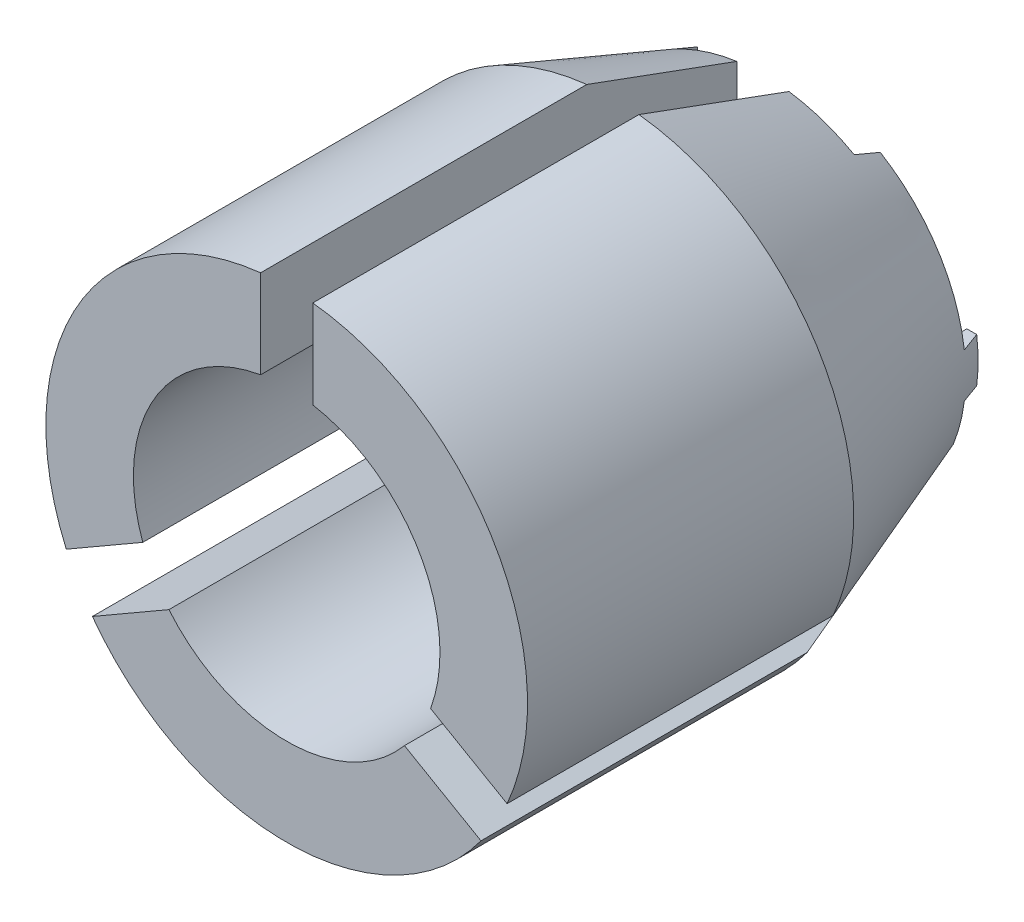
ISO-10303-21;
HEADER;
FILE_DESCRIPTION(('STEP AP214'),'2;1');
FILE_NAME('part.step','',(''),(''),'','','');
FILE_SCHEMA(('AUTOMOTIVE_DESIGN { 1 0 10303 214 1 1 1 1 }'));
ENDSEC;
DATA;
#1=APPLICATION_CONTEXT('core data for automotive mechanical design processes');
#2=APPLICATION_PROTOCOL_DEFINITION('international standard','automotive_design',2000,#1);
#3=PRODUCT_CONTEXT('',#1,'mechanical');
#4=PRODUCT('Part','Part','',(#3));
#5=PRODUCT_RELATED_PRODUCT_CATEGORY('part','',(#4));
#6=PRODUCT_DEFINITION_FORMATION('','',#4);
#7=PRODUCT_DEFINITION_CONTEXT('part definition',#1,'design');
#8=PRODUCT_DEFINITION('design','',#6,#7);
#9=PRODUCT_DEFINITION_SHAPE('','',#8);
#10=(LENGTH_UNIT() NAMED_UNIT(*) SI_UNIT(.MILLI.,.METRE.));
#11=(NAMED_UNIT(*) PLANE_ANGLE_UNIT() SI_UNIT($,.RADIAN.));
#12=(NAMED_UNIT(*) SI_UNIT($,.STERADIAN.) SOLID_ANGLE_UNIT());
#13=UNCERTAINTY_MEASURE_WITH_UNIT(LENGTH_MEASURE(1.E-05),#10,'distance_accuracy_value','');
#14=(GEOMETRIC_REPRESENTATION_CONTEXT(3) GLOBAL_UNCERTAINTY_ASSIGNED_CONTEXT((#13)) GLOBAL_UNIT_ASSIGNED_CONTEXT((#10,
#11,#12)) REPRESENTATION_CONTEXT('',''));
#15=CARTESIAN_POINT('',(0.,0.,0.));
#16=DIRECTION('',(0.,0.,1.));
#17=DIRECTION('',(1.,0.,0.));
#18=AXIS2_PLACEMENT_3D('',#15,#16,#17);
#19=CARTESIAN_POINT('',(2.,25.,40.));
#20=DIRECTION('',(1.,0.,0.));
#21=DIRECTION('',(0.,1.,0.));
#22=AXIS2_PLACEMENT_3D('',#19,#20,#21);
#23=PLANE('',#22);
#24=CARTESIAN_POINT('',(2.,6.41526344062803,-17.2547295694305));
#25=CARTESIAN_POINT('',(2.,6.56390800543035,-16.8648244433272));
#26=CARTESIAN_POINT('',(2.,6.7121636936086,-16.4747713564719));
#27=CARTESIAN_POINT('',(2.,7.0080167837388,-15.6944159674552));
#28=CARTESIAN_POINT('',(2.,7.15561418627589,-15.3041136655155));
#29=CARTESIAN_POINT('',(2.,7.59759766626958,-14.1329043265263));
#30=CARTESIAN_POINT('',(2.,7.89117591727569,-13.3516924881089));
#31=CARTESIAN_POINT('',(2.,8.476797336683,-11.7887002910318));
#32=CARTESIAN_POINT('',(2.,8.76884051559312,-11.0069199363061));
#33=CARTESIAN_POINT('',(2.,9.35178663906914,-9.44293356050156));
#34=CARTESIAN_POINT('',(2.,9.64268958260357,-8.66072753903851));
#35=CARTESIAN_POINT('',(2.,10.533850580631,-6.26048030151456));
#36=CARTESIAN_POINT('',(2.,11.1327080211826,-4.64191919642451));
#37=CARTESIAN_POINT('',(2.,12.3282153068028,-1.40397856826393));
#38=CARTESIAN_POINT('',(2.,12.9248651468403,0.215400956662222));
#39=CARTESIAN_POINT('',(2.,14.10690648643,3.42807582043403));
#40=CARTESIAN_POINT('',(2.,14.6923218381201,5.02136238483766));
#41=CARTESIAN_POINT('',(2.,15.8621656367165,8.20829774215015));
#42=CARTESIAN_POINT('',(2.,16.4465940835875,9.801946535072));
#43=CARTESIAN_POINT('',(2.,18.1988245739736,14.5832760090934));
#44=CARTESIAN_POINT('',(2.,19.3655728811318,17.7713428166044));
#45=CARTESIAN_POINT('',(2.,21.593649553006,23.8641314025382));
#46=CARTESIAN_POINT('',(2.,22.6551132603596,26.7688037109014));
#47=CARTESIAN_POINT('',(2.,24.7771645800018,32.5784684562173));
#48=CARTESIAN_POINT('',(2.,25.8377521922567,35.4834608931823));
#49=CARTESIAN_POINT('',(2.,27.9583314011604,41.2936645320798));
#50=CARTESIAN_POINT('',(2.,29.0183229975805,44.1988757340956));
#51=CARTESIAN_POINT('',(2.,31.1378659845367,50.0094584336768));
#52=CARTESIAN_POINT('',(2.,32.1974173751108,52.9148299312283));
#53=CARTESIAN_POINT('',(2.,33.2568268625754,55.8202531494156));
#54=B_SPLINE_CURVE_WITH_KNOTS('',3,(#24,#25,#26,#27,#28,#29,#30,#31,#32,#33,#34,#35,#36,#37,#38,
#39,#40,#41,#42,#43,#44,#45,#46,#47,#48,#49,#50,#51,#52,#53),.UNSPECIFIED.,.F.,.F.,(4,2,2,2,2,2,
2,2,2,2,2,2,2,2,4),(0.,1.25183440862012,2.50366770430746,5.00732669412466,7.51096852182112,
10.0146126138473,15.1919960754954,20.3693913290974,25.4616848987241,30.5539786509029,
40.7385564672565,50.0161873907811,59.2938186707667,68.5714535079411,77.8490875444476),.UNSPECIFIED.);
#55=CARTESIAN_POINT('',(2.,14.1330853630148,3.5));
#56=VERTEX_POINT('',#55);
#57=CARTESIAN_POINT('',(2.,18.3508886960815,15.));
#58=VERTEX_POINT('',#57);
#59=EDGE_CURVE('E207',#56,#58,#54,.T.);
#60=ORIENTED_EDGE('',*,*,#59,.F.);
#61=DIRECTION('',(0.,-1.,0.));
#62=VECTOR('',#61,1.);
#63=CARTESIAN_POINT('',(2.,0.,3.5));
#64=LINE('',#63,#62);
#65=CARTESIAN_POINT('',(2.,11.5785361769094,3.5));
#66=VERTEX_POINT('',#65);
#67=EDGE_CURVE('E202',#56,#66,#64,.T.);
#68=ORIENTED_EDGE('',*,*,#67,.T.);
#69=DIRECTION('',(0.,0.,-1.));
#70=VECTOR('',#69,1.);
#71=CARTESIAN_POINT('',(2.,11.5785361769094,40.));
#72=LINE('',#71,#70);
#73=CARTESIAN_POINT('',(2.,11.5785361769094,40.));
#74=VERTEX_POINT('',#73);
#75=EDGE_CURVE('E205',#66,#74,#72,.F.);
#76=ORIENTED_EDGE('',*,*,#75,.T.);
#77=DIRECTION('',(0.,-1.,0.));
#78=VECTOR('',#77,1.);
#79=CARTESIAN_POINT('',(2.,25.,40.));
#80=LINE('',#79,#78);
#81=CARTESIAN_POINT('',(2.,18.3508886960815,40.));
#82=VERTEX_POINT('',#81);
#83=EDGE_CURVE('E219',#82,#74,#80,.T.);
#84=ORIENTED_EDGE('',*,*,#83,.F.);
#85=DIRECTION('',(0.,0.,-1.));
#86=VECTOR('',#85,1.);
#87=CARTESIAN_POINT('',(2.,18.3508886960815,40.));
#88=LINE('',#87,#86);
#89=EDGE_CURVE('E214',#58,#82,#88,.F.);
#90=ORIENTED_EDGE('',*,*,#89,.F.);
#91=EDGE_LOOP('',(#60,#68,#76,#84,#90));
#92=FACE_BOUND('',#91,.T.);
#93=ADVANCED_FACE('F38',(#92),#23,.F.);
#94=CARTESIAN_POINT('',(22.6506350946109,-10.7679491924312,40.));
#95=DIRECTION('',(0.500000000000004,0.866025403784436,0.));
#96=DIRECTION('',(-0.866025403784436,0.500000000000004,0.));
#97=AXIS2_PLACEMENT_3D('',#94,#95,#96);
#98=PLANE('',#97);
#99=DIRECTION('',(-0.866025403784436,0.500000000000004,0.));
#100=VECTOR('',#99,1.);
#101=CARTESIAN_POINT('',(22.6506350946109,-10.7679491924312,1.5));
#102=LINE('',#101,#100);
#103=CARTESIAN_POINT('',(12.6025721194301,-4.96669732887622,1.5));
#104=VERTEX_POINT('',#103);
#105=CARTESIAN_POINT('',(11.4664643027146,-4.31076517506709,1.5));
#106=VERTEX_POINT('',#105);
#107=EDGE_CURVE('E46',#104,#106,#102,.T.);
#108=ORIENTED_EDGE('',*,*,#107,.F.);
#109=CARTESIAN_POINT('',(16.8923992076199,-7.44343015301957,15.0002));
#110=CARTESIAN_POINT('',(16.4959240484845,-7.21452511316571,13.7497972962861));
#111=CARTESIAN_POINT('',(16.0993041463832,-6.98553650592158,12.4994557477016));
#112=CARTESIAN_POINT('',(15.3056741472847,-6.52733401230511,9.99893810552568));
#113=CARTESIAN_POINT('',(14.9086640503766,-6.2981201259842,8.74876201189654));
#114=CARTESIAN_POINT('',(14.114152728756,-5.83940880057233,6.24861771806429));
#115=CARTESIAN_POINT('',(13.7166515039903,-5.60991136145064,4.99864951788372));
#116=CARTESIAN_POINT('',(12.9209844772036,-5.15053278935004,2.49899486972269));
#117=CARTESIAN_POINT('',(12.5228186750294,-4.92065165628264,1.24930842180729));
#118=CARTESIAN_POINT('',(12.1242339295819,-4.69052864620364,-0.000199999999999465));
#119=B_SPLINE_CURVE_WITH_KNOTS('',3,(#109,#110,#111,#112,#113,#114,#115,#116,#117,#118),
.UNSPECIFIED.,.F.,.F.,(4,2,2,2,4),(0.,3.99473068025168,7.98946044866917,11.9841906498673,
15.9789217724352),.UNSPECIFIED.);
#120=CARTESIAN_POINT('',(16.8923357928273,-7.44339354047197,15.));
#121=VERTEX_POINT('',#120);
#122=EDGE_CURVE('E224',#121,#104,#119,.T.);
#123=ORIENTED_EDGE('',*,*,#122,.F.);
#124=DIRECTION('',(0.,0.,-1.));
#125=VECTOR('',#124,1.);
#126=CARTESIAN_POINT('',(16.8923357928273,-7.44339354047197,40.));
#127=LINE('',#126,#125);
#128=CARTESIAN_POINT('',(16.8923357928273,-7.44339354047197,40.));
#129=VERTEX_POINT('',#128);
#130=EDGE_CURVE('E212',#129,#121,#127,.T.);
#131=ORIENTED_EDGE('',*,*,#130,.F.);
#132=DIRECTION('',(0.866025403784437,-0.500000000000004,0.));
#133=VECTOR('',#132,1.);
#134=CARTESIAN_POINT('',(22.6506350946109,-10.7679491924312,40.));
#135=LINE('',#134,#133);
#136=CARTESIAN_POINT('',(11.0273064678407,-4.05721728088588,40.));
#137=VERTEX_POINT('',#136);
#138=EDGE_CURVE('E275',#137,#129,#135,.T.);
#139=ORIENTED_EDGE('',*,*,#138,.F.);
#140=DIRECTION('',(0.,0.,-1.));
#141=VECTOR('',#140,1.);
#142=CARTESIAN_POINT('',(11.0273064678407,-4.05721728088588,40.));
#143=LINE('',#142,#141);
#144=CARTESIAN_POINT('',(11.0273064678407,-4.05721728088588,3.5));
#145=VERTEX_POINT('',#144);
#146=EDGE_CURVE('E201',#137,#145,#143,.T.);
#147=ORIENTED_EDGE('',*,*,#146,.T.);
#148=DIRECTION('',(0.866025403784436,-0.500000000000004,0.));
#149=VECTOR('',#148,1.);
#150=CARTESIAN_POINT('',(1.00000000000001,1.73205080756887,3.5));
#151=LINE('',#150,#149);
#152=CARTESIAN_POINT('',(11.4664643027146,-4.31076517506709,3.5));
#153=VERTEX_POINT('',#152);
#154=EDGE_CURVE('E197',#145,#153,#151,.T.);
#155=ORIENTED_EDGE('',*,*,#154,.T.);
#156=DIRECTION('',(0.,0.,-1.));
#157=VECTOR('',#156,1.);
#158=CARTESIAN_POINT('',(11.4664643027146,-4.31076517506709,3.5));
#159=LINE('',#158,#157);
#160=EDGE_CURVE('E206',#106,#153,#159,.F.);
#161=ORIENTED_EDGE('',*,*,#160,.F.);
#162=EDGE_LOOP('',(#108,#123,#131,#139,#147,#155,#161));
#163=FACE_BOUND('',#162,.T.);
#164=ADVANCED_FACE('F231',(#163),#98,.F.);
#165=CARTESIAN_POINT('',(0.,0.,3.5));
#166=DIRECTION('',(0.,0.,-1.));
#167=DIRECTION('',(-1.,0.,0.));
#168=AXIS2_PLACEMENT_3D('',#165,#166,#167);
#169=PLANE('',#168);
#170=ORIENTED_EDGE('',*,*,#154,.F.);
#171=CARTESIAN_POINT('',(0.,0.,3.5));
#172=DIRECTION('',(0.,0.,-1.));
#173=DIRECTION('',(-1.,0.,0.));
#174=AXIS2_PLACEMENT_3D('',#171,#172,#173);
#175=CIRCLE('',#174,11.75);
#176=EDGE_CURVE('E200',#66,#145,#175,.T.);
#177=ORIENTED_EDGE('',*,*,#176,.F.);
#178=ORIENTED_EDGE('',*,*,#67,.F.);
#179=CARTESIAN_POINT('',(0.,0.,3.5));
#180=DIRECTION('',(0.,0.,-1.));
#181=DIRECTION('',(-1.,0.,0.));
#182=AXIS2_PLACEMENT_3D('',#179,#180,#181);
#183=CIRCLE('',#182,14.2738958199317);
#184=CARTESIAN_POINT('',(7.,12.4396182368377,3.5));
#185=VERTEX_POINT('',#184);
#186=EDGE_CURVE('E150',#56,#185,#183,.T.);
#187=ORIENTED_EDGE('',*,*,#186,.T.);
#188=DIRECTION('',(0.,-1.,0.));
#189=VECTOR('',#188,1.);
#190=CARTESIAN_POINT('',(7.,15.,3.5));
#191=LINE('',#190,#189);
#192=CARTESIAN_POINT('',(7.,10.0529846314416,3.5));
#193=VERTEX_POINT('',#192);
#194=EDGE_CURVE('E140',#185,#193,#191,.T.);
#195=ORIENTED_EDGE('',*,*,#194,.T.);
#196=CARTESIAN_POINT('',(0.,0.,3.5));
#197=DIRECTION('',(0.,0.,-1.));
#198=DIRECTION('',(-1.,0.,0.));
#199=AXIS2_PLACEMENT_3D('',#196,#197,#198);
#200=CIRCLE('',#199,12.25);
#201=EDGE_CURVE('E139',#193,#153,#200,.T.);
#202=ORIENTED_EDGE('',*,*,#201,.T.);
#203=EDGE_LOOP('',(#170,#177,#178,#187,#195,#202));
#204=FACE_BOUND('',#203,.T.);
#205=ADVANCED_FACE('F234',(#204),#169,.T.);
#206=CARTESIAN_POINT('',(0.,0.,0.));
#207=DIRECTION('',(0.,0.,1.));
#208=DIRECTION('',(1.,0.,0.));
#209=AXIS2_PLACEMENT_3D('',#206,#207,#208);
#210=CONICAL_SURFACE('',#209,13.,0.349065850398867);
#211=CARTESIAN_POINT('',(0.,0.,1.5));
#212=DIRECTION('',(0.,0.,-1.));
#213=DIRECTION('',(-1.,0.,0.));
#214=AXIS2_PLACEMENT_3D('',#211,#212,#213);
#215=CIRCLE('',#214,13.5459553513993);
#216=CARTESIAN_POINT('',(7.,11.5971076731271,1.5));
#217=VERTEX_POINT('',#216);
#218=CARTESIAN_POINT('',(13.4388580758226,1.7,1.5));
#219=VERTEX_POINT('',#218);
#220=EDGE_CURVE('E155',#217,#219,#215,.T.);
#221=ORIENTED_EDGE('',*,*,#220,.F.);
#222=CARTESIAN_POINT('',(7.,6.33155002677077,-9.78466875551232));
#223=CARTESIAN_POINT('',(7.,6.46686668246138,-9.53522790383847));
#224=CARTESIAN_POINT('',(7.,6.60037631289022,-9.28481541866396));
#225=CARTESIAN_POINT('',(7.,6.86422301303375,-8.78233731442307));
#226=CARTESIAN_POINT('',(7.,6.99456022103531,-8.53027176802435));
#227=CARTESIAN_POINT('',(7.,7.25249382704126,-8.02479793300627));
#228=CARTESIAN_POINT('',(7.,7.38009067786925,-7.77138987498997));
#229=CARTESIAN_POINT('',(7.,7.63290689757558,-7.26338795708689));
#230=CARTESIAN_POINT('',(7.,7.75812623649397,-7.00879408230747));
#231=CARTESIAN_POINT('',(7.,8.13054932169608,-6.24372815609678));
#232=CARTESIAN_POINT('',(7.,8.37463658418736,-5.73173823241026));
#233=CARTESIAN_POINT('',(7.,8.85628357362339,-4.70467804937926));
#234=CARTESIAN_POINT('',(7.,9.09384297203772,-4.18960763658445));
#235=CARTESIAN_POINT('',(7.,9.56353125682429,-3.1574215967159));
#236=CARTESIAN_POINT('',(7.,9.7956637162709,-2.64030759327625));
#237=CARTESIAN_POINT('',(7.,10.2556100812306,-1.60417674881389));
#238=CARTESIAN_POINT('',(7.,10.4834240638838,-1.08515994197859));
#239=CARTESIAN_POINT('',(7.,10.9354948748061,-0.0454937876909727));
#240=CARTESIAN_POINT('',(7.,11.1597511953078,0.47515578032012));
#241=CARTESIAN_POINT('',(7.,11.6052387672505,1.51774934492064));
#242=CARTESIAN_POINT('',(7.,11.826470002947,2.03969334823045));
#243=CARTESIAN_POINT('',(7.,12.3820083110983,3.35938377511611));
#244=CARTESIAN_POINT('',(7.,12.7146083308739,4.1578486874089));
#245=CARTESIAN_POINT('',(7.,13.3750477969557,5.75674300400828));
#246=CARTESIAN_POINT('',(7.,13.702887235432,6.55717241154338));
#247=CARTESIAN_POINT('',(7.,14.3546825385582,8.15956462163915));
#248=CARTESIAN_POINT('',(7.,14.6786385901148,8.96152734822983));
#249=CARTESIAN_POINT('',(7.,15.3233640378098,10.5667329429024));
#250=CARTESIAN_POINT('',(7.,15.6441334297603,11.3699758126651));
#251=CARTESIAN_POINT('',(7.,16.2833019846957,12.9782513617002));
#252=CARTESIAN_POINT('',(7.,16.6016987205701,13.7832850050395));
#253=CARTESIAN_POINT('',(7.,17.2362403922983,15.3942395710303));
#254=CARTESIAN_POINT('',(7.,17.5523853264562,16.2001604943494));
#255=CARTESIAN_POINT('',(7.,18.1827585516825,17.8127547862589));
#256=CARTESIAN_POINT('',(7.,18.4969868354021,18.6194281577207));
#257=CARTESIAN_POINT('',(7.,19.1237827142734,20.2334173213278));
#258=CARTESIAN_POINT('',(7.,19.4363503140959,21.040733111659));
#259=CARTESIAN_POINT('',(7.,19.7482170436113,21.8483189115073));
#260=B_SPLINE_CURVE_WITH_KNOTS('',3,(#222,#223,#224,#225,#226,#227,#228,#229,#230,#231,#232,
#233,#234,#235,#236,#237,#238,#239,#240,#241,#242,#243,#244,#245,#246,#247,#248,#249,#250,#251,
#252,#253,#254,#255,#256,#257,#258,#259),.UNSPECIFIED.,.F.,.F.,(4,2,2,2,2,2,2,2,2,2,2,2,2,2,2,2,
2,2,4),(0.,0.851322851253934,1.70260852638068,2.55375243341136,3.40490705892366,
5.10643075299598,6.80803992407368,8.50849527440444,10.208920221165,11.9095857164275,
13.6102600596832,16.2051417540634,18.8000277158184,21.3947882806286,23.9895522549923,
26.5866814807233,29.1838126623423,31.7809537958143,34.3780876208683),.UNSPECIFIED.);
#261=EDGE_CURVE('E52',#217,#185,#260,.T.);
#262=ORIENTED_EDGE('',*,*,#261,.T.);
#263=ORIENTED_EDGE('',*,*,#186,.F.);
#264=ORIENTED_EDGE('',*,*,#59,.T.);
#265=CARTESIAN_POINT('',(0.,0.,15.));
#266=DIRECTION('',(0.,0.,1.));
#267=DIRECTION('',(1.,0.,0.));
#268=AXIS2_PLACEMENT_3D('',#265,#266,#267);
#269=CIRCLE('',#268,18.4595535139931);
#270=EDGE_CURVE('E218',#121,#58,#269,.T.);
#271=ORIENTED_EDGE('',*,*,#270,.F.);
#272=ORIENTED_EDGE('',*,*,#122,.T.);
#273=CARTESIAN_POINT('',(0.,0.,1.5));
#274=DIRECTION('',(0.,0.,-1.));
#275=DIRECTION('',(-1.,0.,0.));
#276=AXIS2_PLACEMENT_3D('',#273,#274,#275);
#277=CIRCLE('',#276,13.5459553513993);
#278=CARTESIAN_POINT('',(13.4388580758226,-1.7,1.5));
#279=VERTEX_POINT('',#278);
#280=EDGE_CURVE('E60',#279,#104,#277,.T.);
#281=ORIENTED_EDGE('',*,*,#280,.F.);
#282=CARTESIAN_POINT('',(17.3009539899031,-1.7,12.0456959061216));
#283=CARTESIAN_POINT('',(16.954158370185,-1.7,11.0974515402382));
#284=CARTESIAN_POINT('',(16.6072765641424,-1.7,10.1492387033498));
#285=CARTESIAN_POINT('',(15.9133002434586,-1.7,8.25289080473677));
#286=CARTESIAN_POINT('',(15.566205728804,-1.7,7.30475574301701));
#287=CARTESIAN_POINT('',(14.5245433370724,-1.7,4.46049126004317));
#288=CARTESIAN_POINT('',(13.8295959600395,-1.7,2.56450075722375));
#289=CARTESIAN_POINT('',(12.7859906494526,-1.7,-0.279051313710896));
#290=CARTESIAN_POINT('',(12.4379246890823,-1.7,-1.22683012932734));
#291=CARTESIAN_POINT('',(11.7412798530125,-1.7,-3.12219914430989));
#292=CARTESIAN_POINT('',(11.3927009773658,-1.7,-4.06978934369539));
#293=CARTESIAN_POINT('',(10.694880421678,-1.7,-5.96472673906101));
#294=CARTESIAN_POINT('',(10.3456387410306,-1.7,-6.912073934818));
#295=CARTESIAN_POINT('',(9.64623724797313,-1.7,-8.80642968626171));
#296=CARTESIAN_POINT('',(9.29607743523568,-1.7,-9.75343824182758));
#297=CARTESIAN_POINT('',(8.94533085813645,-1.7,-10.7002297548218));
#298=B_SPLINE_CURVE_WITH_KNOTS('',3,(#282,#283,#284,#285,#286,#287,#288,#289,#290,#291,#292,
#293,#294,#295,#296,#297),.UNSPECIFIED.,.F.,.F.,(4,2,2,2,2,2,2,4),(0.,3.02901156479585,
6.05802332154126,12.1160411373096,15.1450526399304,18.1740638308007,21.2030777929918,
24.2320928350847),.UNSPECIFIED.);
#299=CARTESIAN_POINT('',(12.8883668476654,-1.7,0.));
#300=VERTEX_POINT('',#299);
#301=EDGE_CURVE('E189',#279,#300,#298,.T.);
#302=ORIENTED_EDGE('',*,*,#301,.T.);
#303=CARTESIAN_POINT('',(0.,0.,0.));
#304=DIRECTION('',(0.,0.,1.));
#305=DIRECTION('',(1.,0.,0.));
#306=AXIS2_PLACEMENT_3D('',#303,#304,#305);
#307=CIRCLE('',#306,13.);
#308=CARTESIAN_POINT('',(12.8883668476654,1.7,0.));
#309=VERTEX_POINT('',#308);
#310=EDGE_CURVE('E213',#300,#309,#307,.T.);
#311=ORIENTED_EDGE('',*,*,#310,.T.);
#312=CARTESIAN_POINT('',(8.94533085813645,1.7,-10.7002297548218));
#313=CARTESIAN_POINT('',(9.29607743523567,1.7,-9.75343824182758));
#314=CARTESIAN_POINT('',(9.64623724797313,1.7,-8.80642968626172));
#315=CARTESIAN_POINT('',(10.3456387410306,1.7,-6.91207393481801));
#316=CARTESIAN_POINT('',(10.694880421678,1.7,-5.96472673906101));
#317=CARTESIAN_POINT('',(11.3927009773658,1.7,-4.0697893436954));
#318=CARTESIAN_POINT('',(11.7412798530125,1.7,-3.12219914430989));
#319=CARTESIAN_POINT('',(12.4379246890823,1.7,-1.22683012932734));
#320=CARTESIAN_POINT('',(12.7859906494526,1.7,-0.279051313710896));
#321=CARTESIAN_POINT('',(13.8295959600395,1.7,2.56450075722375));
#322=CARTESIAN_POINT('',(14.5245433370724,1.7,4.46049126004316));
#323=CARTESIAN_POINT('',(15.566205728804,1.7,7.30475574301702));
#324=CARTESIAN_POINT('',(15.9133002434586,1.7,8.25289080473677));
#325=CARTESIAN_POINT('',(16.6072765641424,1.7,10.1492387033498));
#326=CARTESIAN_POINT('',(16.954158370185,1.7,11.0974515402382));
#327=CARTESIAN_POINT('',(17.3009539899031,1.7,12.0456959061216));
#328=B_SPLINE_CURVE_WITH_KNOTS('',3,(#312,#313,#314,#315,#316,#317,#318,#319,#320,#321,#322,
#323,#324,#325,#326,#327),.UNSPECIFIED.,.F.,.F.,(4,2,2,2,2,2,2,4),(0.,3.02901504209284,
6.05802900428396,9.08704019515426,12.1160516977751,18.1740695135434,21.2030812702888,
24.2320928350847),.UNSPECIFIED.);
#329=EDGE_CURVE('E157',#309,#219,#328,.T.);
#330=ORIENTED_EDGE('',*,*,#329,.T.);
#331=EDGE_LOOP('',(#221,#262,#263,#264,#271,#272,#281,#302,#311,#330));
#332=FACE_BOUND('',#331,.T.);
#333=ADVANCED_FACE('F167',(#332),#210,.T.);
#334=CARTESIAN_POINT('',(0.,0.,0.));
#335=DIRECTION('',(0.,0.,1.));
#336=DIRECTION('',(1.,0.,0.));
#337=AXIS2_PLACEMENT_3D('',#334,#335,#336);
#338=PLANE('',#337);
#339=CARTESIAN_POINT('',(0.,0.,0.));
#340=DIRECTION('',(0.,0.,-1.));
#341=DIRECTION('',(-1.,0.,0.));
#342=AXIS2_PLACEMENT_3D('',#339,#340,#341);
#343=CIRCLE('',#342,12.25);
#344=CARTESIAN_POINT('',(12.1314673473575,1.7,0.));
#345=VERTEX_POINT('',#344);
#346=CARTESIAN_POINT('',(12.1314673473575,-1.7,0.));
#347=VERTEX_POINT('',#346);
#348=EDGE_CURVE('E222',#345,#347,#343,.T.);
#349=ORIENTED_EDGE('',*,*,#348,.F.);
#350=DIRECTION('',(-1.,0.,0.));
#351=VECTOR('',#350,1.);
#352=CARTESIAN_POINT('',(12.1314673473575,1.7,0.));
#353=LINE('',#352,#351);
#354=EDGE_CURVE('E146',#309,#345,#353,.T.);
#355=ORIENTED_EDGE('',*,*,#354,.F.);
#356=ORIENTED_EDGE('',*,*,#310,.F.);
#357=DIRECTION('',(1.,0.,0.));
#358=VECTOR('',#357,1.);
#359=CARTESIAN_POINT('',(12.1314673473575,-1.7,0.));
#360=LINE('',#359,#358);
#361=EDGE_CURVE('E165',#347,#300,#360,.T.);
#362=ORIENTED_EDGE('',*,*,#361,.F.);
#363=EDGE_LOOP('',(#349,#355,#356,#362));
#364=FACE_BOUND('',#363,.T.);
#365=ADVANCED_FACE('F239',(#364),#338,.F.);
#366=CARTESIAN_POINT('',(0.,0.,40.));
#367=DIRECTION('',(0.,0.,-1.));
#368=DIRECTION('',(-1.,0.,0.));
#369=AXIS2_PLACEMENT_3D('',#366,#367,#368);
#370=CYLINDRICAL_SURFACE('',#369,18.4595535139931);
#371=CARTESIAN_POINT('',(0.,0.,40.));
#372=DIRECTION('',(0.,0.,1.));
#373=DIRECTION('',(1.,0.,0.));
#374=AXIS2_PLACEMENT_3D('',#371,#372,#373);
#375=CIRCLE('',#374,18.4595535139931);
#376=EDGE_CURVE('E223',#129,#82,#375,.T.);
#377=ORIENTED_EDGE('',*,*,#376,.F.);
#378=ORIENTED_EDGE('',*,*,#130,.T.);
#379=ORIENTED_EDGE('',*,*,#270,.T.);
#380=ORIENTED_EDGE('',*,*,#89,.T.);
#381=EDGE_LOOP('',(#377,#378,#379,#380));
#382=FACE_BOUND('',#381,.T.);
#383=ADVANCED_FACE('F236',(#382),#370,.T.);
#384=CARTESIAN_POINT('',(0.,0.,40.));
#385=DIRECTION('',(0.,0.,1.));
#386=DIRECTION('',(1.,0.,0.));
#387=AXIS2_PLACEMENT_3D('',#384,#385,#386);
#388=PLANE('',#387);
#389=CARTESIAN_POINT('',(0.,0.,40.));
#390=DIRECTION('',(0.,0.,-1.));
#391=DIRECTION('',(-1.,0.,0.));
#392=AXIS2_PLACEMENT_3D('',#389,#390,#391);
#393=CIRCLE('',#392,11.75);
#394=EDGE_CURVE('E217',#74,#137,#393,.T.);
#395=ORIENTED_EDGE('',*,*,#394,.T.);
#396=ORIENTED_EDGE('',*,*,#138,.T.);
#397=ORIENTED_EDGE('',*,*,#376,.T.);
#398=ORIENTED_EDGE('',*,*,#83,.T.);
#399=EDGE_LOOP('',(#395,#396,#397,#398));
#400=FACE_BOUND('',#399,.T.);
#401=ADVANCED_FACE('F238',(#400),#388,.T.);
#402=CARTESIAN_POINT('',(0.,0.,3.5));
#403=DIRECTION('',(0.,0.,-1.));
#404=DIRECTION('',(-1.,0.,0.));
#405=AXIS2_PLACEMENT_3D('',#402,#403,#404);
#406=CYLINDRICAL_SURFACE('',#405,12.25);
#407=ORIENTED_EDGE('',*,*,#201,.F.);
#408=DIRECTION('',(0.,0.,-1.));
#409=VECTOR('',#408,1.);
#410=CARTESIAN_POINT('',(7.,10.0529846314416,3.5));
#411=LINE('',#410,#409);
#412=CARTESIAN_POINT('',(7.,10.0529846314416,1.5));
#413=VERTEX_POINT('',#412);
#414=EDGE_CURVE('E127',#193,#413,#411,.T.);
#415=ORIENTED_EDGE('',*,*,#414,.T.);
#416=CARTESIAN_POINT('',(0.,0.,1.5));
#417=DIRECTION('',(0.,0.,1.));
#418=DIRECTION('',(-1.,0.,0.));
#419=AXIS2_PLACEMENT_3D('',#416,#417,#418);
#420=CIRCLE('',#419,12.25);
#421=CARTESIAN_POINT('',(12.1314673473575,1.7,1.5));
#422=VERTEX_POINT('',#421);
#423=EDGE_CURVE('E137',#422,#413,#420,.T.);
#424=ORIENTED_EDGE('',*,*,#423,.F.);
#425=DIRECTION('',(0.,0.,-1.));
#426=VECTOR('',#425,1.);
#427=CARTESIAN_POINT('',(12.1314673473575,1.7,1.5));
#428=LINE('',#427,#426);
#429=EDGE_CURVE('E148',#422,#345,#428,.T.);
#430=ORIENTED_EDGE('',*,*,#429,.T.);
#431=ORIENTED_EDGE('',*,*,#348,.T.);
#432=DIRECTION('',(0.,0.,-1.));
#433=VECTOR('',#432,1.);
#434=CARTESIAN_POINT('',(12.1314673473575,-1.7,1.5));
#435=LINE('',#434,#433);
#436=CARTESIAN_POINT('',(12.1314673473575,-1.7,1.5));
#437=VERTEX_POINT('',#436);
#438=EDGE_CURVE('E367',#437,#347,#435,.T.);
#439=ORIENTED_EDGE('',*,*,#438,.F.);
#440=CARTESIAN_POINT('',(0.,0.,1.5));
#441=DIRECTION('',(0.,0.,1.));
#442=DIRECTION('',(-1.,0.,0.));
#443=AXIS2_PLACEMENT_3D('',#440,#441,#442);
#444=CIRCLE('',#443,12.25);
#445=EDGE_CURVE('E364',#106,#437,#444,.T.);
#446=ORIENTED_EDGE('',*,*,#445,.F.);
#447=ORIENTED_EDGE('',*,*,#160,.T.);
#448=EDGE_LOOP('',(#407,#415,#424,#430,#431,#439,#446,#447));
#449=FACE_BOUND('',#448,.T.);
#450=ADVANCED_FACE('F135',(#449),#406,.F.);
#451=CARTESIAN_POINT('',(0.,0.,40.));
#452=DIRECTION('',(0.,0.,-1.));
#453=DIRECTION('',(-1.,0.,0.));
#454=AXIS2_PLACEMENT_3D('',#451,#452,#453);
#455=CYLINDRICAL_SURFACE('',#454,11.75);
#456=ORIENTED_EDGE('',*,*,#176,.T.);
#457=ORIENTED_EDGE('',*,*,#146,.F.);
#458=ORIENTED_EDGE('',*,*,#394,.F.);
#459=ORIENTED_EDGE('',*,*,#75,.F.);
#460=EDGE_LOOP('',(#456,#457,#458,#459));
#461=FACE_BOUND('',#460,.T.);
#462=ADVANCED_FACE('F40',(#461),#455,.F.);
#463=CARTESIAN_POINT('',(12.1314673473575,-1.7,1.5));
#464=DIRECTION('',(0.,1.,0.));
#465=DIRECTION('',(-1.,0.,0.));
#466=AXIS2_PLACEMENT_3D('',#463,#464,#465);
#467=PLANE('',#466);
#468=DIRECTION('',(1.,0.,0.));
#469=VECTOR('',#468,1.);
#470=CARTESIAN_POINT('',(12.1314673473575,-1.7,1.5));
#471=LINE('',#470,#469);
#472=EDGE_CURVE('E365',#437,#279,#471,.T.);
#473=ORIENTED_EDGE('',*,*,#472,.F.);
#474=ORIENTED_EDGE('',*,*,#438,.T.);
#475=ORIENTED_EDGE('',*,*,#361,.T.);
#476=ORIENTED_EDGE('',*,*,#301,.F.);
#477=EDGE_LOOP('',(#473,#474,#475,#476));
#478=FACE_BOUND('',#477,.T.);
#479=ADVANCED_FACE('F181',(#478),#467,.F.);
#480=CARTESIAN_POINT('',(0.,0.,1.5));
#481=DIRECTION('',(0.,0.,-1.));
#482=DIRECTION('',(-1.,0.,0.));
#483=AXIS2_PLACEMENT_3D('',#480,#481,#482);
#484=PLANE('',#483);
#485=ORIENTED_EDGE('',*,*,#280,.T.);
#486=ORIENTED_EDGE('',*,*,#107,.T.);
#487=ORIENTED_EDGE('',*,*,#445,.T.);
#488=ORIENTED_EDGE('',*,*,#472,.T.);
#489=EDGE_LOOP('',(#485,#486,#487,#488));
#490=FACE_BOUND('',#489,.T.);
#491=ADVANCED_FACE('F176',(#490),#484,.T.);
#492=CARTESIAN_POINT('',(12.1314673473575,1.7,1.5));
#493=DIRECTION('',(0.,-1.,0.));
#494=DIRECTION('',(1.,0.,0.));
#495=AXIS2_PLACEMENT_3D('',#492,#493,#494);
#496=PLANE('',#495);
#497=ORIENTED_EDGE('',*,*,#354,.T.);
#498=ORIENTED_EDGE('',*,*,#429,.F.);
#499=DIRECTION('',(-1.,0.,0.));
#500=VECTOR('',#499,1.);
#501=CARTESIAN_POINT('',(12.1314673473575,1.7,1.5));
#502=LINE('',#501,#500);
#503=EDGE_CURVE('E144',#219,#422,#502,.T.);
#504=ORIENTED_EDGE('',*,*,#503,.F.);
#505=ORIENTED_EDGE('',*,*,#329,.F.);
#506=EDGE_LOOP('',(#497,#498,#504,#505));
#507=FACE_BOUND('',#506,.T.);
#508=ADVANCED_FACE('F171',(#507),#496,.F.);
#509=CARTESIAN_POINT('',(0.,0.,1.5));
#510=DIRECTION('',(0.,0.,-1.));
#511=DIRECTION('',(-1.,0.,0.));
#512=AXIS2_PLACEMENT_3D('',#509,#510,#511);
#513=PLANE('',#512);
#514=DIRECTION('',(0.,-1.,0.));
#515=VECTOR('',#514,1.);
#516=CARTESIAN_POINT('',(7.,0.,1.5));
#517=LINE('',#516,#515);
#518=EDGE_CURVE('E12',#217,#413,#517,.T.);
#519=ORIENTED_EDGE('',*,*,#518,.F.);
#520=ORIENTED_EDGE('',*,*,#220,.T.);
#521=ORIENTED_EDGE('',*,*,#503,.T.);
#522=ORIENTED_EDGE('',*,*,#423,.T.);
#523=EDGE_LOOP('',(#519,#520,#521,#522));
#524=FACE_BOUND('',#523,.T.);
#525=ADVANCED_FACE('F142',(#524),#513,.T.);
#526=CARTESIAN_POINT('',(7.,15.,3.5));
#527=DIRECTION('',(1.,0.,0.));
#528=DIRECTION('',(0.,1.,0.));
#529=AXIS2_PLACEMENT_3D('',#526,#527,#528);
#530=PLANE('',#529);
#531=ORIENTED_EDGE('',*,*,#518,.T.);
#532=ORIENTED_EDGE('',*,*,#414,.F.);
#533=ORIENTED_EDGE('',*,*,#194,.F.);
#534=ORIENTED_EDGE('',*,*,#261,.F.);
#535=EDGE_LOOP('',(#531,#532,#533,#534));
#536=FACE_BOUND('',#535,.T.);
#537=ADVANCED_FACE('F126',(#536),#530,.F.);
#538=CLOSED_SHELL('',(#93,#164,#205,#333,#365,#383,#401,#450,#462,#479,#491,#508,#525,#537));
#539=MANIFOLD_SOLID_BREP('B2',#538);
#540=CARTESIAN_POINT('',(0.,0.,3.5));
#541=DIRECTION('',(0.,0.,-1.));
#542=DIRECTION('',(-1.,0.,0.));
#543=AXIS2_PLACEMENT_3D('',#540,#541,#542);
#544=CYLINDRICAL_SURFACE('',#543,12.25);
#545=CARTESIAN_POINT('',(0.,0.,1.5));
#546=DIRECTION('',(0.,0.,1.));
#547=DIRECTION('',(-1.,0.,0.));
#548=AXIS2_PLACEMENT_3D('',#545,#546,#547);
#549=CIRCLE('',#548,12.25);
#550=CARTESIAN_POINT('',(7.,-10.0529846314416,1.5));
#551=VERTEX_POINT('',#550);
#552=CARTESIAN_POINT('',(9.46646430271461,-7.77486679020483,1.5));
#553=VERTEX_POINT('',#552);
#554=EDGE_CURVE('E408',#551,#553,#549,.T.);
#555=ORIENTED_EDGE('',*,*,#554,.F.);
#556=DIRECTION('',(0.,0.,-1.));
#557=VECTOR('',#556,1.);
#558=CARTESIAN_POINT('',(7.,-10.0529846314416,3.5));
#559=LINE('',#558,#557);
#560=CARTESIAN_POINT('',(7.,-10.0529846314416,3.5));
#561=VERTEX_POINT('',#560);
#562=EDGE_CURVE('E596',#551,#561,#559,.F.);
#563=ORIENTED_EDGE('',*,*,#562,.T.);
#564=CARTESIAN_POINT('',(0.,0.,3.5));
#565=DIRECTION('',(0.,0.,-1.));
#566=DIRECTION('',(-1.,0.,0.));
#567=AXIS2_PLACEMENT_3D('',#564,#565,#566);
#568=CIRCLE('',#567,12.25);
#569=CARTESIAN_POINT('',(9.46646430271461,-7.77486679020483,3.5));
#570=VERTEX_POINT('',#569);
#571=EDGE_CURVE('E561',#570,#561,#568,.T.);
#572=ORIENTED_EDGE('',*,*,#571,.F.);
#573=DIRECTION('',(0.,0.,-1.));
#574=VECTOR('',#573,1.);
#575=CARTESIAN_POINT('',(9.46646430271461,-7.77486679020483,3.5));
#576=LINE('',#575,#574);
#577=EDGE_CURVE('E502',#570,#553,#576,.T.);
#578=ORIENTED_EDGE('',*,*,#577,.T.);
#579=EDGE_LOOP('',(#555,#563,#572,#578));
#580=FACE_BOUND('',#579,.T.);
#581=ADVANCED_FACE('F385',(#580),#544,.F.);
#582=CARTESIAN_POINT('',(0.,0.,1.5));
#583=DIRECTION('',(0.,0.,-1.));
#584=DIRECTION('',(-1.,0.,0.));
#585=AXIS2_PLACEMENT_3D('',#582,#583,#584);
#586=PLANE('',#585);
#587=DIRECTION('',(0.,-1.,0.));
#588=VECTOR('',#587,1.);
#589=CARTESIAN_POINT('',(7.,0.,1.5));
#590=LINE('',#589,#588);
#591=CARTESIAN_POINT('',(7.,-11.5971076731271,1.5));
#592=VERTEX_POINT('',#591);
#593=EDGE_CURVE('E36',#551,#592,#590,.T.);
#594=ORIENTED_EDGE('',*,*,#593,.F.);
#595=ORIENTED_EDGE('',*,*,#554,.T.);
#596=DIRECTION('',(0.866025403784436,-0.500000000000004,0.));
#597=VECTOR('',#596,1.);
#598=CARTESIAN_POINT('',(20.6506350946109,-14.232050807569,1.5));
#599=LINE('',#598,#597);
#600=CARTESIAN_POINT('',(10.6025721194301,-8.43079894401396,1.5));
#601=VERTEX_POINT('',#600);
#602=EDGE_CURVE('E473',#553,#601,#599,.T.);
#603=ORIENTED_EDGE('',*,*,#602,.T.);
#604=CARTESIAN_POINT('',(0.,0.,1.5));
#605=DIRECTION('',(0.,0.,-1.));
#606=DIRECTION('',(-1.,0.,0.));
#607=AXIS2_PLACEMENT_3D('',#604,#605,#606);
#608=CIRCLE('',#607,13.5459553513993);
#609=EDGE_CURVE('E489',#601,#592,#608,.T.);
#610=ORIENTED_EDGE('',*,*,#609,.T.);
#611=EDGE_LOOP('',(#594,#595,#603,#610));
#612=FACE_BOUND('',#611,.T.);
#613=ADVANCED_FACE('F565',(#612),#586,.T.);
#614=CARTESIAN_POINT('',(0.,0.,0.));
#615=DIRECTION('',(0.,0.,1.));
#616=DIRECTION('',(1.,0.,0.));
#617=AXIS2_PLACEMENT_3D('',#614,#615,#616);
#618=CONICAL_SURFACE('',#617,13.,0.349065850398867);
#619=CARTESIAN_POINT('',(0.,0.,3.5));
#620=DIRECTION('',(0.,0.,-1.));
#621=DIRECTION('',(-1.,0.,0.));
#622=AXIS2_PLACEMENT_3D('',#619,#620,#621);
#623=CIRCLE('',#622,14.2738958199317);
#624=CARTESIAN_POINT('',(7.,-12.4396182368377,3.5));
#625=VERTEX_POINT('',#624);
#626=CARTESIAN_POINT('',(-7.,-12.4396182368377,3.5));
#627=VERTEX_POINT('',#626);
#628=EDGE_CURVE('E491',#625,#627,#623,.T.);
#629=ORIENTED_EDGE('',*,*,#628,.F.);
#630=CARTESIAN_POINT('',(7.,-17.0713451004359,14.975860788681));
#631=CARTESIAN_POINT('',(7.,-16.8690099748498,14.4615159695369));
#632=CARTESIAN_POINT('',(7.,-16.6662303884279,13.947346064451));
#633=CARTESIAN_POINT('',(7.,-16.2596726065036,12.9194004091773));
#634=CARTESIAN_POINT('',(7.,-16.0558944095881,12.4056246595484));
#635=CARTESIAN_POINT('',(7.,-15.4429108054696,10.8649889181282));
#636=CARTESIAN_POINT('',(7.,-15.0320439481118,9.8387887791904));
#637=CARTESIAN_POINT('',(7.,-14.204945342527,7.78921648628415));
#638=CARTESIAN_POINT('',(7.,-13.7887167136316,6.76584307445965));
#639=CARTESIAN_POINT('',(7.,-12.9490271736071,4.72200576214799));
#640=CARTESIAN_POINT('',(7.,-12.5255659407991,3.70154199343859));
#641=CARTESIAN_POINT('',(7.,-11.88301262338,2.17354120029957));
#642=CARTESIAN_POINT('',(7.,-11.6675279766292,1.66448695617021));
#643=CARTESIAN_POINT('',(7.,-11.2337279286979,0.647586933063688));
#644=CARTESIAN_POINT('',(7.,-11.0154125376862,0.139741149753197));
#645=CARTESIAN_POINT('',(7.,-10.575467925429,-0.874447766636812));
#646=CARTESIAN_POINT('',(7.,-10.3538390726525,-1.38079105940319));
#647=CARTESIAN_POINT('',(7.,-9.9065913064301,-2.39172357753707));
#648=CARTESIAN_POINT('',(7.,-9.68097233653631,-2.89631277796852));
#649=CARTESIAN_POINT('',(7.,-9.22476510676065,-3.90361889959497));
#650=CARTESIAN_POINT('',(7.,-8.99417385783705,-4.40633446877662));
#651=CARTESIAN_POINT('',(7.,-8.52705510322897,-5.40898524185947));
#652=CARTESIAN_POINT('',(7.,-8.29052783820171,-5.90892055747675));
#653=CARTESIAN_POINT('',(7.,-7.93008488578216,-6.65621189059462));
#654=CARTESIAN_POINT('',(7.,-7.80897179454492,-6.90492049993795));
#655=CARTESIAN_POINT('',(7.,-7.56462225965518,-7.40129054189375));
#656=CARTESIAN_POINT('',(7.,-7.44138583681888,-7.64895198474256));
#657=CARTESIAN_POINT('',(7.,-7.19248503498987,-8.14309560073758));
#658=CARTESIAN_POINT('',(7.,-7.06682033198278,-8.38957761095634));
#659=CARTESIAN_POINT('',(7.,-6.81270269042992,-8.88110981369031));
#660=CARTESIAN_POINT('',(7.,-6.68424965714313,-9.12615995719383));
#661=CARTESIAN_POINT('',(7.,-6.5542185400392,-9.3703762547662));
#662=B_SPLINE_CURVE_WITH_KNOTS('',3,(#630,#631,#632,#633,#634,#635,#636,#637,#638,#639,#640,
#641,#642,#643,#644,#645,#646,#647,#648,#649,#650,#651,#652,#653,#654,#655,#656,#657,#658,#659,
#660,#661),.UNSPECIFIED.,.F.,.F.,(4,2,2,2,2,2,2,2,2,2,2,2,2,2,2,4),(0.,1.6581342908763,
3.31627092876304,6.63244217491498,9.94676425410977,13.2612341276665,14.9195786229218,
16.5779171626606,18.236072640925,19.8942515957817,21.553456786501,23.2125948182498,
24.0424776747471,24.8723524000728,25.7023386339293,26.532353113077),.UNSPECIFIED.);
#663=EDGE_CURVE('E572',#625,#592,#662,.T.);
#664=ORIENTED_EDGE('',*,*,#663,.T.);
#665=ORIENTED_EDGE('',*,*,#609,.F.);
#666=CARTESIAN_POINT('',(10.1242339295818,-8.15463026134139,-0.000200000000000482));
#667=CARTESIAN_POINT('',(10.5228186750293,-8.38475327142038,1.24930842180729));
#668=CARTESIAN_POINT('',(10.9209844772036,-8.61463440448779,2.49899486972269));
#669=CARTESIAN_POINT('',(11.7166515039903,-9.07401297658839,4.99864951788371));
#670=CARTESIAN_POINT('',(12.114152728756,-9.30351041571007,6.24861771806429));
#671=CARTESIAN_POINT('',(12.9086640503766,-9.76222174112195,8.74876201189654));
#672=CARTESIAN_POINT('',(13.3056741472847,-9.99143562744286,9.99893810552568));
#673=CARTESIAN_POINT('',(14.0993041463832,-10.4496381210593,12.4994557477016));
#674=CARTESIAN_POINT('',(14.4959240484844,-10.6786267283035,13.7497972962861));
#675=CARTESIAN_POINT('',(14.8923992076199,-10.9075317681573,15.0002));
#676=B_SPLINE_CURVE_WITH_KNOTS('',3,(#666,#667,#668,#669,#670,#671,#672,#673,#674,#675),
.UNSPECIFIED.,.F.,.F.,(4,2,2,2,4),(0.,3.99473112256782,7.98946132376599,11.9841910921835,
15.9789217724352),.UNSPECIFIED.);
#677=CARTESIAN_POINT('',(14.8923357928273,-10.9074951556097,15.));
#678=VERTEX_POINT('',#677);
#679=EDGE_CURVE('E509',#601,#678,#676,.T.);
#680=ORIENTED_EDGE('',*,*,#679,.T.);
#681=CARTESIAN_POINT('',(0.,0.,15.));
#682=DIRECTION('',(0.,0.,1.));
#683=DIRECTION('',(1.,0.,0.));
#684=AXIS2_PLACEMENT_3D('',#681,#682,#683);
#685=CIRCLE('',#684,18.4595535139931);
#686=CARTESIAN_POINT('',(-14.8923357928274,-10.9074951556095,15.));
#687=VERTEX_POINT('',#686);
#688=EDGE_CURVE('E546',#687,#678,#685,.T.);
#689=ORIENTED_EDGE('',*,*,#688,.F.);
#690=CARTESIAN_POINT('',(-14.8923992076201,-10.9075317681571,15.0002));
#691=CARTESIAN_POINT('',(-14.4959240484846,-10.6786267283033,13.7497972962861));
#692=CARTESIAN_POINT('',(-14.0993041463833,-10.4496381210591,12.4994557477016));
#693=CARTESIAN_POINT('',(-13.3056741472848,-9.99143562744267,9.99893810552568));
#694=CARTESIAN_POINT('',(-12.9086640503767,-9.76222174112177,8.74876201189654));
#695=CARTESIAN_POINT('',(-12.1141527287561,-9.3035104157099,6.24861771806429));
#696=CARTESIAN_POINT('',(-11.7166515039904,-9.07401297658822,4.99864951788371));
#697=CARTESIAN_POINT('',(-10.9209844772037,-8.61463440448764,2.49899486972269));
#698=CARTESIAN_POINT('',(-10.5228186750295,-8.38475327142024,1.24930842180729));
#699=CARTESIAN_POINT('',(-10.124233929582,-8.15463026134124,-0.00020000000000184));
#700=B_SPLINE_CURVE_WITH_KNOTS('',3,(#690,#691,#692,#693,#694,#695,#696,#697,#698,#699),
.UNSPECIFIED.,.F.,.F.,(4,2,2,2,4),(0.,3.99473068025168,7.98946044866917,11.9841906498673,
15.9789217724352),.UNSPECIFIED.);
#701=CARTESIAN_POINT('',(-10.6025721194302,-8.43079894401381,1.5));
#702=VERTEX_POINT('',#701);
#703=EDGE_CURVE('E517',#687,#702,#700,.T.);
#704=ORIENTED_EDGE('',*,*,#703,.T.);
#705=CARTESIAN_POINT('',(-7.,-11.5971076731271,1.5));
#706=VERTEX_POINT('',#705);
#707=EDGE_CURVE('E487',#706,#702,#608,.T.);
#708=ORIENTED_EDGE('',*,*,#707,.F.);
#709=CARTESIAN_POINT('',(-7.,-6.55421854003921,-9.3703762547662));
#710=CARTESIAN_POINT('',(-7.,-6.68424965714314,-9.12615995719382));
#711=CARTESIAN_POINT('',(-7.,-6.81270269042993,-8.8811098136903));
#712=CARTESIAN_POINT('',(-7.,-7.06682033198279,-8.38957761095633));
#713=CARTESIAN_POINT('',(-7.,-7.19248503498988,-8.14309560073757));
#714=CARTESIAN_POINT('',(-7.,-7.44138583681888,-7.64895198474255));
#715=CARTESIAN_POINT('',(-7.,-7.56462225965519,-7.40129054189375));
#716=CARTESIAN_POINT('',(-7.,-7.80897179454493,-6.90492049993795));
#717=CARTESIAN_POINT('',(-7.,-7.93008488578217,-6.65621189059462));
#718=CARTESIAN_POINT('',(-7.,-8.29052783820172,-5.90892055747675));
#719=CARTESIAN_POINT('',(-7.,-8.52705510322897,-5.40898524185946));
#720=CARTESIAN_POINT('',(-7.,-8.99417385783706,-4.40633446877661));
#721=CARTESIAN_POINT('',(-7.,-9.22476510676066,-3.90361889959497));
#722=CARTESIAN_POINT('',(-7.,-9.68097233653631,-2.89631277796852));
#723=CARTESIAN_POINT('',(-7.,-9.90659130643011,-2.39172357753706));
#724=CARTESIAN_POINT('',(-7.,-10.3538390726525,-1.38079105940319));
#725=CARTESIAN_POINT('',(-7.,-10.575467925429,-0.874447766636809));
#726=CARTESIAN_POINT('',(-7.,-11.0154125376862,0.139741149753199));
#727=CARTESIAN_POINT('',(-7.,-11.2337279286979,0.64758693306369));
#728=CARTESIAN_POINT('',(-7.,-11.6675279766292,1.66448695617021));
#729=CARTESIAN_POINT('',(-7.,-11.88301262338,2.17354120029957));
#730=CARTESIAN_POINT('',(-7.,-12.5255659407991,3.70154199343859));
#731=CARTESIAN_POINT('',(-7.,-12.9490271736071,4.72200576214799));
#732=CARTESIAN_POINT('',(-7.,-13.7887167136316,6.76584307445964));
#733=CARTESIAN_POINT('',(-7.,-14.204945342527,7.78921648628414));
#734=CARTESIAN_POINT('',(-7.,-15.0320439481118,9.83878877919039));
#735=CARTESIAN_POINT('',(-7.,-15.4429108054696,10.8649889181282));
#736=CARTESIAN_POINT('',(-7.,-16.0558944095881,12.4056246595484));
#737=CARTESIAN_POINT('',(-7.,-16.2596726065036,12.9194004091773));
#738=CARTESIAN_POINT('',(-7.,-16.6662303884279,13.947346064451));
#739=CARTESIAN_POINT('',(-7.,-16.8690099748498,14.4615159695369));
#740=CARTESIAN_POINT('',(-7.,-17.0713451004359,14.9758607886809));
#741=B_SPLINE_CURVE_WITH_KNOTS('',3,(#709,#710,#711,#712,#713,#714,#715,#716,#717,#718,#719,
#720,#721,#722,#723,#724,#725,#726,#727,#728,#729,#730,#731,#732,#733,#734,#735,#736,#737,#738,
#739,#740),.UNSPECIFIED.,.F.,.F.,(4,2,2,2,2,2,2,2,2,2,2,2,2,2,2,4),(0.,0.83001447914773,
1.6600007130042,2.48987543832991,3.31975829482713,4.97889632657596,6.63810151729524,
8.29628047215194,9.95443595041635,11.6127744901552,13.2711189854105,16.5855888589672,
19.899910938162,23.2160821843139,24.8742188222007,26.532353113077),.UNSPECIFIED.);
#742=EDGE_CURVE('E400',#706,#627,#741,.T.);
#743=ORIENTED_EDGE('',*,*,#742,.T.);
#744=EDGE_LOOP('',(#629,#664,#665,#680,#689,#704,#708,#743));
#745=FACE_BOUND('',#744,.T.);
#746=ADVANCED_FACE('F520',(#745),#618,.T.);
#747=CARTESIAN_POINT('',(-7.,-10.0529846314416,3.5));
#748=VERTEX_POINT('',#747);
#749=CARTESIAN_POINT('',(-9.46646430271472,-7.7748667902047,3.5));
#750=VERTEX_POINT('',#749);
#751=EDGE_CURVE('E481',#748,#750,#568,.T.);
#752=ORIENTED_EDGE('',*,*,#751,.F.);
#753=DIRECTION('',(0.,0.,-1.));
#754=VECTOR('',#753,1.);
#755=CARTESIAN_POINT('',(-7.,-10.0529846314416,3.5));
#756=LINE('',#755,#754);
#757=CARTESIAN_POINT('',(-7.,-10.0529846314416,1.5));
#758=VERTEX_POINT('',#757);
#759=EDGE_CURVE('E468',#748,#758,#756,.T.);
#760=ORIENTED_EDGE('',*,*,#759,.T.);
#761=CARTESIAN_POINT('',(-9.46646430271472,-7.7748667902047,1.5));
#762=VERTEX_POINT('',#761);
#763=EDGE_CURVE('E479',#762,#758,#549,.T.);
#764=ORIENTED_EDGE('',*,*,#763,.F.);
#765=DIRECTION('',(0.,0.,-1.));
#766=VECTOR('',#765,1.);
#767=CARTESIAN_POINT('',(-9.46646430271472,-7.7748667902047,3.5));
#768=LINE('',#767,#766);
#769=EDGE_CURVE('E516',#762,#750,#768,.F.);
#770=ORIENTED_EDGE('',*,*,#769,.T.);
#771=EDGE_LOOP('',(#752,#760,#764,#770));
#772=FACE_BOUND('',#771,.T.);
#773=ADVANCED_FACE('F477',(#772),#544,.F.);
#774=CARTESIAN_POINT('',(-20.6506350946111,-14.2320508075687,40.));
#775=DIRECTION('',(0.499999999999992,-0.866025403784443,0.));
#776=DIRECTION('',(0.866025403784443,0.499999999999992,0.));
#777=AXIS2_PLACEMENT_3D('',#774,#775,#776);
#778=PLANE('',#777);
#779=DIRECTION('',(0.866025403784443,0.499999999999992,0.));
#780=VECTOR('',#779,1.);
#781=CARTESIAN_POINT('',(-20.6506350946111,-14.2320508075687,1.5));
#782=LINE('',#781,#780);
#783=EDGE_CURVE('E486',#702,#762,#782,.T.);
#784=ORIENTED_EDGE('',*,*,#783,.F.);
#785=ORIENTED_EDGE('',*,*,#703,.F.);
#786=DIRECTION('',(0.,0.,-1.));
#787=VECTOR('',#786,1.);
#788=CARTESIAN_POINT('',(-14.8923357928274,-10.9074951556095,40.));
#789=LINE('',#788,#787);
#790=CARTESIAN_POINT('',(-14.8923357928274,-10.9074951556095,40.));
#791=VERTEX_POINT('',#790);
#792=EDGE_CURVE('E497',#791,#687,#789,.T.);
#793=ORIENTED_EDGE('',*,*,#792,.F.);
#794=DIRECTION('',(-0.866025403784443,-0.499999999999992,0.));
#795=VECTOR('',#794,1.);
#796=CARTESIAN_POINT('',(-20.6506350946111,-14.2320508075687,40.));
#797=LINE('',#796,#795);
#798=CARTESIAN_POINT('',(-9.02730646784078,-7.5213188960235,40.));
#799=VERTEX_POINT('',#798);
#800=EDGE_CURVE('E548',#799,#791,#797,.T.);
#801=ORIENTED_EDGE('',*,*,#800,.F.);
#802=DIRECTION('',(0.,0.,-1.));
#803=VECTOR('',#802,1.);
#804=CARTESIAN_POINT('',(-9.02730646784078,-7.5213188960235,40.));
#805=LINE('',#804,#803);
#806=CARTESIAN_POINT('',(-9.02730646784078,-7.5213188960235,3.5));
#807=VERTEX_POINT('',#806);
#808=EDGE_CURVE('E498',#799,#807,#805,.T.);
#809=ORIENTED_EDGE('',*,*,#808,.T.);
#810=DIRECTION('',(-0.866025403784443,-0.499999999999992,0.));
#811=VECTOR('',#810,1.);
#812=CARTESIAN_POINT('',(0.999999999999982,-1.73205080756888,3.5));
#813=LINE('',#812,#811);
#814=EDGE_CURVE('E501',#807,#750,#813,.T.);
#815=ORIENTED_EDGE('',*,*,#814,.T.);
#816=ORIENTED_EDGE('',*,*,#769,.F.);
#817=EDGE_LOOP('',(#784,#785,#793,#801,#809,#815,#816));
#818=FACE_BOUND('',#817,.T.);
#819=ADVANCED_FACE('F530',(#818),#778,.F.);
#820=CARTESIAN_POINT('',(20.6506350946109,-14.232050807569,40.));
#821=DIRECTION('',(-0.500000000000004,-0.866025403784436,0.));
#822=DIRECTION('',(0.866025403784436,-0.500000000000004,0.));
#823=AXIS2_PLACEMENT_3D('',#820,#821,#822);
#824=PLANE('',#823);
#825=ORIENTED_EDGE('',*,*,#602,.F.);
#826=ORIENTED_EDGE('',*,*,#577,.F.);
#827=DIRECTION('',(-0.866025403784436,0.500000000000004,0.));
#828=VECTOR('',#827,1.);
#829=CARTESIAN_POINT('',(-1.00000000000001,-1.73205080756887,3.5));
#830=LINE('',#829,#828);
#831=CARTESIAN_POINT('',(9.02730646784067,-7.52131889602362,3.5));
#832=VERTEX_POINT('',#831);
#833=EDGE_CURVE('E505',#570,#832,#830,.T.);
#834=ORIENTED_EDGE('',*,*,#833,.T.);
#835=DIRECTION('',(0.,0.,-1.));
#836=VECTOR('',#835,1.);
#837=CARTESIAN_POINT('',(9.02730646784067,-7.52131889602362,40.));
#838=LINE('',#837,#836);
#839=CARTESIAN_POINT('',(9.02730646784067,-7.52131889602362,40.));
#840=VERTEX_POINT('',#839);
#841=EDGE_CURVE('E508',#832,#840,#838,.F.);
#842=ORIENTED_EDGE('',*,*,#841,.T.);
#843=DIRECTION('',(-0.866025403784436,0.500000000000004,0.));
#844=VECTOR('',#843,1.);
#845=CARTESIAN_POINT('',(20.6506350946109,-14.232050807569,40.));
#846=LINE('',#845,#844);
#847=CARTESIAN_POINT('',(14.8923357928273,-10.9074951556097,40.));
#848=VERTEX_POINT('',#847);
#849=EDGE_CURVE('E543',#848,#840,#846,.T.);
#850=ORIENTED_EDGE('',*,*,#849,.F.);
#851=DIRECTION('',(0.,0.,-1.));
#852=VECTOR('',#851,1.);
#853=CARTESIAN_POINT('',(14.8923357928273,-10.9074951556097,40.));
#854=LINE('',#853,#852);
#855=EDGE_CURVE('E518',#678,#848,#854,.F.);
#856=ORIENTED_EDGE('',*,*,#855,.F.);
#857=ORIENTED_EDGE('',*,*,#679,.F.);
#858=EDGE_LOOP('',(#825,#826,#834,#842,#850,#856,#857));
#859=FACE_BOUND('',#858,.T.);
#860=ADVANCED_FACE('F524',(#859),#824,.F.);
#861=CARTESIAN_POINT('',(0.,0.,40.));
#862=DIRECTION('',(0.,0.,-1.));
#863=DIRECTION('',(-1.,0.,0.));
#864=AXIS2_PLACEMENT_3D('',#861,#862,#863);
#865=CYLINDRICAL_SURFACE('',#864,18.4595535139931);
#866=CARTESIAN_POINT('',(0.,0.,40.));
#867=DIRECTION('',(0.,0.,1.));
#868=DIRECTION('',(1.,0.,0.));
#869=AXIS2_PLACEMENT_3D('',#866,#867,#868);
#870=CIRCLE('',#869,18.4595535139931);
#871=EDGE_CURVE('E550',#791,#848,#870,.T.);
#872=ORIENTED_EDGE('',*,*,#871,.F.);
#873=ORIENTED_EDGE('',*,*,#792,.T.);
#874=ORIENTED_EDGE('',*,*,#688,.T.);
#875=ORIENTED_EDGE('',*,*,#855,.T.);
#876=EDGE_LOOP('',(#872,#873,#874,#875));
#877=FACE_BOUND('',#876,.T.);
#878=ADVANCED_FACE('F529',(#877),#865,.T.);
#879=CARTESIAN_POINT('',(0.,0.,3.5));
#880=DIRECTION('',(0.,0.,-1.));
#881=DIRECTION('',(-1.,0.,0.));
#882=AXIS2_PLACEMENT_3D('',#879,#880,#881);
#883=PLANE('',#882);
#884=ORIENTED_EDGE('',*,*,#814,.F.);
#885=CARTESIAN_POINT('',(0.,0.,3.5));
#886=DIRECTION('',(0.,0.,-1.));
#887=DIRECTION('',(-1.,0.,0.));
#888=AXIS2_PLACEMENT_3D('',#885,#886,#887);
#889=CIRCLE('',#888,11.75);
#890=EDGE_CURVE('E557',#832,#807,#889,.T.);
#891=ORIENTED_EDGE('',*,*,#890,.F.);
#892=ORIENTED_EDGE('',*,*,#833,.F.);
#893=ORIENTED_EDGE('',*,*,#571,.T.);
#894=DIRECTION('',(0.,-1.,0.));
#895=VECTOR('',#894,1.);
#896=CARTESIAN_POINT('',(7.,15.,3.5));
#897=LINE('',#896,#895);
#898=EDGE_CURVE('E587',#561,#625,#897,.T.);
#899=ORIENTED_EDGE('',*,*,#898,.T.);
#900=ORIENTED_EDGE('',*,*,#628,.T.);
#901=DIRECTION('',(0.,1.,0.));
#902=VECTOR('',#901,1.);
#903=CARTESIAN_POINT('',(-7.,15.,3.5));
#904=LINE('',#903,#902);
#905=EDGE_CURVE('E482',#627,#748,#904,.T.);
#906=ORIENTED_EDGE('',*,*,#905,.T.);
#907=ORIENTED_EDGE('',*,*,#751,.T.);
#908=EDGE_LOOP('',(#884,#891,#892,#893,#899,#900,#906,#907));
#909=FACE_BOUND('',#908,.T.);
#910=ADVANCED_FACE('F584',(#909),#883,.T.);
#911=CARTESIAN_POINT('',(0.,0.,40.));
#912=DIRECTION('',(0.,0.,1.));
#913=DIRECTION('',(1.,0.,0.));
#914=AXIS2_PLACEMENT_3D('',#911,#912,#913);
#915=PLANE('',#914);
#916=CARTESIAN_POINT('',(0.,0.,40.));
#917=DIRECTION('',(0.,0.,-1.));
#918=DIRECTION('',(-1.,0.,0.));
#919=AXIS2_PLACEMENT_3D('',#916,#917,#918);
#920=CIRCLE('',#919,11.75);
#921=EDGE_CURVE('E551',#840,#799,#920,.T.);
#922=ORIENTED_EDGE('',*,*,#921,.T.);
#923=ORIENTED_EDGE('',*,*,#800,.T.);
#924=ORIENTED_EDGE('',*,*,#871,.T.);
#925=ORIENTED_EDGE('',*,*,#849,.T.);
#926=EDGE_LOOP('',(#922,#923,#924,#925));
#927=FACE_BOUND('',#926,.T.);
#928=ADVANCED_FACE('F611',(#927),#915,.T.);
#929=CARTESIAN_POINT('',(0.,0.,40.));
#930=DIRECTION('',(0.,0.,-1.));
#931=DIRECTION('',(-1.,0.,0.));
#932=AXIS2_PLACEMENT_3D('',#929,#930,#931);
#933=CYLINDRICAL_SURFACE('',#932,11.75);
#934=ORIENTED_EDGE('',*,*,#890,.T.);
#935=ORIENTED_EDGE('',*,*,#808,.F.);
#936=ORIENTED_EDGE('',*,*,#921,.F.);
#937=ORIENTED_EDGE('',*,*,#841,.F.);
#938=EDGE_LOOP('',(#934,#935,#936,#937));
#939=FACE_BOUND('',#938,.T.);
#940=ADVANCED_FACE('F387',(#939),#933,.F.);
#941=DIRECTION('',(0.,1.,0.));
#942=VECTOR('',#941,1.);
#943=CARTESIAN_POINT('',(-7.,0.,1.5));
#944=LINE('',#943,#942);
#945=EDGE_CURVE('E393',#706,#758,#944,.T.);
#946=ORIENTED_EDGE('',*,*,#945,.F.);
#947=ORIENTED_EDGE('',*,*,#707,.T.);
#948=ORIENTED_EDGE('',*,*,#783,.T.);
#949=ORIENTED_EDGE('',*,*,#763,.T.);
#950=EDGE_LOOP('',(#946,#947,#948,#949));
#951=FACE_BOUND('',#950,.T.);
#952=ADVANCED_FACE('F484',(#951),#586,.T.);
#953=CARTESIAN_POINT('',(7.,15.,3.5));
#954=DIRECTION('',(1.,0.,0.));
#955=DIRECTION('',(0.,1.,0.));
#956=AXIS2_PLACEMENT_3D('',#953,#954,#955);
#957=PLANE('',#956);
#958=ORIENTED_EDGE('',*,*,#898,.F.);
#959=ORIENTED_EDGE('',*,*,#562,.F.);
#960=ORIENTED_EDGE('',*,*,#593,.T.);
#961=ORIENTED_EDGE('',*,*,#663,.F.);
#962=EDGE_LOOP('',(#958,#959,#960,#961));
#963=FACE_BOUND('',#962,.T.);
#964=ADVANCED_FACE('F599',(#963),#957,.F.);
#965=CARTESIAN_POINT('',(-7.,15.,3.5));
#966=DIRECTION('',(-1.,0.,0.));
#967=DIRECTION('',(0.,0.,1.));
#968=AXIS2_PLACEMENT_3D('',#965,#966,#967);
#969=PLANE('',#968);
#970=ORIENTED_EDGE('',*,*,#945,.T.);
#971=ORIENTED_EDGE('',*,*,#759,.F.);
#972=ORIENTED_EDGE('',*,*,#905,.F.);
#973=ORIENTED_EDGE('',*,*,#742,.F.);
#974=EDGE_LOOP('',(#970,#971,#972,#973));
#975=FACE_BOUND('',#974,.T.);
#976=ADVANCED_FACE('F467',(#975),#969,.F.);
#977=CLOSED_SHELL('',(#581,#613,#746,#773,#819,#860,#878,#910,#928,#940,#952,#964,#976));
#978=MANIFOLD_SOLID_BREP('B6',#977);
#979=CARTESIAN_POINT('',(-2.,25.,40.));
#980=DIRECTION('',(-1.,0.,0.));
#981=DIRECTION('',(0.,-1.,0.));
#982=AXIS2_PLACEMENT_3D('',#979,#980,#981);
#983=PLANE('',#982);
#984=DIRECTION('',(0.,1.,0.));
#985=VECTOR('',#984,1.);
#986=CARTESIAN_POINT('',(-2.,0.,3.5));
#987=LINE('',#986,#985);
#988=CARTESIAN_POINT('',(-2.,11.5785361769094,3.5));
#989=VERTEX_POINT('',#988);
#990=CARTESIAN_POINT('',(-2.,14.1330853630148,3.5));
#991=VERTEX_POINT('',#990);
#992=EDGE_CURVE('E875',#989,#991,#987,.T.);
#993=ORIENTED_EDGE('',*,*,#992,.T.);
#994=CARTESIAN_POINT('',(-2.,6.41526344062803,-17.2547295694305));
#995=CARTESIAN_POINT('',(-2.,6.56390800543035,-16.8648244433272));
#996=CARTESIAN_POINT('',(-2.,6.7121636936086,-16.4747713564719));
#997=CARTESIAN_POINT('',(-2.,7.0080167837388,-15.6944159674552));
#998=CARTESIAN_POINT('',(-2.,7.15561418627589,-15.3041136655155));
#999=CARTESIAN_POINT('',(-2.,7.59759766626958,-14.1329043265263));
#1000=CARTESIAN_POINT('',(-2.,7.89117591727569,-13.3516924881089));
#1001=CARTESIAN_POINT('',(-2.,8.476797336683,-11.7887002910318));
#1002=CARTESIAN_POINT('',(-2.,8.76884051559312,-11.0069199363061));
#1003=CARTESIAN_POINT('',(-2.,9.35178663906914,-9.44293356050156));
#1004=CARTESIAN_POINT('',(-2.,9.64268958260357,-8.66072753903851));
#1005=CARTESIAN_POINT('',(-2.,10.533850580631,-6.26048030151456));
#1006=CARTESIAN_POINT('',(-2.,11.1327080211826,-4.64191919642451));
#1007=CARTESIAN_POINT('',(-2.,12.3282153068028,-1.40397856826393));
#1008=CARTESIAN_POINT('',(-2.,12.9248651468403,0.215400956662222));
#1009=CARTESIAN_POINT('',(-2.,14.10690648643,3.42807582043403));
#1010=CARTESIAN_POINT('',(-2.,14.6923218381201,5.02136238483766));
#1011=CARTESIAN_POINT('',(-2.,15.8621656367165,8.20829774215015));
#1012=CARTESIAN_POINT('',(-2.,16.4465940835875,9.801946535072));
#1013=CARTESIAN_POINT('',(-2.,18.1988245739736,14.5832760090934));
#1014=CARTESIAN_POINT('',(-2.,19.3655728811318,17.7713428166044));
#1015=CARTESIAN_POINT('',(-2.,21.593649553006,23.8641314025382));
#1016=CARTESIAN_POINT('',(-2.,22.6551132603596,26.7688037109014));
#1017=CARTESIAN_POINT('',(-2.,24.7771645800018,32.5784684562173));
#1018=CARTESIAN_POINT('',(-2.,25.8377521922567,35.4834608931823));
#1019=CARTESIAN_POINT('',(-2.,27.9583314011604,41.2936645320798));
#1020=CARTESIAN_POINT('',(-2.,29.0183229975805,44.1988757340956));
#1021=CARTESIAN_POINT('',(-2.,31.1378659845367,50.0094584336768));
#1022=CARTESIAN_POINT('',(-2.,32.1974173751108,52.9148299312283));
#1023=CARTESIAN_POINT('',(-2.,33.2568268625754,55.8202531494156));
#1024=B_SPLINE_CURVE_WITH_KNOTS('',3,(#994,#995,#996,#997,#998,#999,#1000,#1001,#1002,#1003,
#1004,#1005,#1006,#1007,#1008,#1009,#1010,#1011,#1012,#1013,#1014,#1015,#1016,#1017,#1018,#1019,
#1020,#1021,#1022,#1023),.UNSPECIFIED.,.F.,.F.,(4,2,2,2,2,2,2,2,2,2,2,2,2,2,4),(0.,
1.25183440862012,2.50366770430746,5.00732669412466,7.51096852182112,10.0146126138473,
15.1919960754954,20.3693913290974,25.4616848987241,30.5539786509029,40.7385564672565,
50.0161873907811,59.2938186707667,68.5714535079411,77.8490875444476),.UNSPECIFIED.);
#1025=CARTESIAN_POINT('',(-2.,18.3508886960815,15.));
#1026=VERTEX_POINT('',#1025);
#1027=EDGE_CURVE('E855',#1026,#991,#1024,.F.);
#1028=ORIENTED_EDGE('',*,*,#1027,.F.);
#1029=DIRECTION('',(0.,0.,-1.));
#1030=VECTOR('',#1029,1.);
#1031=CARTESIAN_POINT('',(-2.,18.3508886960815,40.));
#1032=LINE('',#1031,#1030);
#1033=CARTESIAN_POINT('',(-2.,18.3508886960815,40.));
#1034=VERTEX_POINT('',#1033);
#1035=EDGE_CURVE('E861',#1034,#1026,#1032,.T.);
#1036=ORIENTED_EDGE('',*,*,#1035,.F.);
#1037=DIRECTION('',(0.,1.,0.));
#1038=VECTOR('',#1037,1.);
#1039=CARTESIAN_POINT('',(-2.,25.,40.));
#1040=LINE('',#1039,#1038);
#1041=CARTESIAN_POINT('',(-2.,11.5785361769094,40.));
#1042=VERTEX_POINT('',#1041);
#1043=EDGE_CURVE('E837',#1042,#1034,#1040,.T.);
#1044=ORIENTED_EDGE('',*,*,#1043,.F.);
#1045=DIRECTION('',(0.,0.,-1.));
#1046=VECTOR('',#1045,1.);
#1047=CARTESIAN_POINT('',(-2.,11.5785361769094,40.));
#1048=LINE('',#1047,#1046);
#1049=EDGE_CURVE('E817',#1042,#989,#1048,.T.);
#1050=ORIENTED_EDGE('',*,*,#1049,.T.);
#1051=EDGE_LOOP('',(#993,#1028,#1036,#1044,#1050));
#1052=FACE_BOUND('',#1051,.T.);
#1053=ADVANCED_FACE('F689',(#1052),#983,.F.);
#1054=CARTESIAN_POINT('',(-22.6506350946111,-10.7679491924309,40.));
#1055=DIRECTION('',(-0.499999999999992,0.866025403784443,0.));
#1056=DIRECTION('',(-0.866025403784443,-0.499999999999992,0.));
#1057=AXIS2_PLACEMENT_3D('',#1054,#1055,#1056);
#1058=PLANE('',#1057);
#1059=DIRECTION('',(-0.866025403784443,-0.499999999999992,0.));
#1060=VECTOR('',#1059,1.);
#1061=CARTESIAN_POINT('',(-22.6506350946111,-10.7679491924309,1.5));
#1062=LINE('',#1061,#1060);
#1063=CARTESIAN_POINT('',(-11.4664643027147,-4.31076517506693,1.5));
#1064=VERTEX_POINT('',#1063);
#1065=CARTESIAN_POINT('',(-12.6025721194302,-4.96669732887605,1.5));
#1066=VERTEX_POINT('',#1065);
#1067=EDGE_CURVE('E880',#1064,#1066,#1062,.T.);
#1068=ORIENTED_EDGE('',*,*,#1067,.F.);
#1069=DIRECTION('',(0.,0.,-1.));
#1070=VECTOR('',#1069,1.);
#1071=CARTESIAN_POINT('',(-11.4664643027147,-4.31076517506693,3.5));
#1072=LINE('',#1071,#1070);
#1073=CARTESIAN_POINT('',(-11.4664643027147,-4.31076517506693,3.5));
#1074=VERTEX_POINT('',#1073);
#1075=EDGE_CURVE('E825',#1074,#1064,#1072,.T.);
#1076=ORIENTED_EDGE('',*,*,#1075,.F.);
#1077=DIRECTION('',(0.866025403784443,0.499999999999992,0.));
#1078=VECTOR('',#1077,1.);
#1079=CARTESIAN_POINT('',(-0.999999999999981,1.73205080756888,3.5));
#1080=LINE('',#1079,#1078);
#1081=CARTESIAN_POINT('',(-11.0273064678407,-4.05721728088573,3.5));
#1082=VERTEX_POINT('',#1081);
#1083=EDGE_CURVE('E877',#1074,#1082,#1080,.T.);
#1084=ORIENTED_EDGE('',*,*,#1083,.T.);
#1085=DIRECTION('',(0.,0.,-1.));
#1086=VECTOR('',#1085,1.);
#1087=CARTESIAN_POINT('',(-11.0273064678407,-4.05721728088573,40.));
#1088=LINE('',#1087,#1086);
#1089=CARTESIAN_POINT('',(-11.0273064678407,-4.05721728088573,40.));
#1090=VERTEX_POINT('',#1089);
#1091=EDGE_CURVE('E814',#1082,#1090,#1088,.F.);
#1092=ORIENTED_EDGE('',*,*,#1091,.T.);
#1093=DIRECTION('',(0.866025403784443,0.499999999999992,0.));
#1094=VECTOR('',#1093,1.);
#1095=CARTESIAN_POINT('',(-22.6506350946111,-10.7679491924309,40.));
#1096=LINE('',#1095,#1094);
#1097=CARTESIAN_POINT('',(-16.8923357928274,-7.44339354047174,40.));
#1098=VERTEX_POINT('',#1097);
#1099=EDGE_CURVE('E822',#1098,#1090,#1096,.T.);
#1100=ORIENTED_EDGE('',*,*,#1099,.F.);
#1101=DIRECTION('',(0.,0.,-1.));
#1102=VECTOR('',#1101,1.);
#1103=CARTESIAN_POINT('',(-16.8923357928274,-7.44339354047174,40.));
#1104=LINE('',#1103,#1102);
#1105=CARTESIAN_POINT('',(-16.8923357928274,-7.44339354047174,15.));
#1106=VERTEX_POINT('',#1105);
#1107=EDGE_CURVE('E828',#1106,#1098,#1104,.F.);
#1108=ORIENTED_EDGE('',*,*,#1107,.F.);
#1109=CARTESIAN_POINT('',(-12.1242339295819,-4.69052864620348,-0.000200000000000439));
#1110=CARTESIAN_POINT('',(-12.5228186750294,-4.92065165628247,1.24930842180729));
#1111=CARTESIAN_POINT('',(-12.9209844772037,-5.15053278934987,2.49899486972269));
#1112=CARTESIAN_POINT('',(-13.7166515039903,-5.60991136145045,4.99864951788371));
#1113=CARTESIAN_POINT('',(-14.114152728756,-5.83940880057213,6.24861771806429));
#1114=CARTESIAN_POINT('',(-14.9086640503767,-6.298120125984,8.74876201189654));
#1115=CARTESIAN_POINT('',(-15.3056741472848,-6.5273340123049,9.99893810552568));
#1116=CARTESIAN_POINT('',(-16.0993041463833,-6.98553650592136,12.4994557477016));
#1117=CARTESIAN_POINT('',(-16.4959240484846,-7.21452511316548,13.7497972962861));
#1118=CARTESIAN_POINT('',(-16.89239920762,-7.44343015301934,15.0002));
#1119=B_SPLINE_CURVE_WITH_KNOTS('',3,(#1109,#1110,#1111,#1112,#1113,#1114,#1115,#1116,#1117,
#1118),.UNSPECIFIED.,.F.,.F.,(4,2,2,2,4),(0.,3.99473112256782,7.98946132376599,11.9841910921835,
15.9789217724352),.UNSPECIFIED.);
#1120=EDGE_CURVE('E831',#1066,#1106,#1119,.T.);
#1121=ORIENTED_EDGE('',*,*,#1120,.F.);
#1122=EDGE_LOOP('',(#1068,#1076,#1084,#1092,#1100,#1108,#1121));
#1123=FACE_BOUND('',#1122,.T.);
#1124=ADVANCED_FACE('F839',(#1123),#1058,.F.);
#1125=CARTESIAN_POINT('',(0.,0.,3.5));
#1126=DIRECTION('',(0.,0.,-1.));
#1127=DIRECTION('',(-1.,0.,0.));
#1128=AXIS2_PLACEMENT_3D('',#1125,#1126,#1127);
#1129=CYLINDRICAL_SURFACE('',#1128,12.25);
#1130=CARTESIAN_POINT('',(0.,0.,1.5));
#1131=DIRECTION('',(0.,0.,1.));
#1132=DIRECTION('',(-1.,0.,0.));
#1133=AXIS2_PLACEMENT_3D('',#1130,#1131,#1132);
#1134=CIRCLE('',#1133,12.25);
#1135=CARTESIAN_POINT('',(-7.,10.0529846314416,1.5));
#1136=VERTEX_POINT('',#1135);
#1137=CARTESIAN_POINT('',(-12.1314673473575,1.7,1.5));
#1138=VERTEX_POINT('',#1137);
#1139=EDGE_CURVE('E916',#1136,#1138,#1134,.T.);
#1140=ORIENTED_EDGE('',*,*,#1139,.F.);
#1141=DIRECTION('',(0.,0.,-1.));
#1142=VECTOR('',#1141,1.);
#1143=CARTESIAN_POINT('',(-7.,10.0529846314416,3.5));
#1144=LINE('',#1143,#1142);
#1145=CARTESIAN_POINT('',(-7.,10.0529846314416,3.5));
#1146=VERTEX_POINT('',#1145);
#1147=EDGE_CURVE('E704',#1136,#1146,#1144,.F.);
#1148=ORIENTED_EDGE('',*,*,#1147,.T.);
#1149=CARTESIAN_POINT('',(0.,0.,3.5));
#1150=DIRECTION('',(0.,0.,-1.));
#1151=DIRECTION('',(-1.,0.,0.));
#1152=AXIS2_PLACEMENT_3D('',#1149,#1150,#1151);
#1153=CIRCLE('',#1152,12.25);
#1154=EDGE_CURVE('E864',#1074,#1146,#1153,.T.);
#1155=ORIENTED_EDGE('',*,*,#1154,.F.);
#1156=ORIENTED_EDGE('',*,*,#1075,.T.);
#1157=CARTESIAN_POINT('',(0.,0.,1.5));
#1158=DIRECTION('',(0.,0.,1.));
#1159=DIRECTION('',(-1.,0.,0.));
#1160=AXIS2_PLACEMENT_3D('',#1157,#1158,#1159);
#1161=CIRCLE('',#1160,12.25);
#1162=CARTESIAN_POINT('',(-12.1314673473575,-1.7,1.5));
#1163=VERTEX_POINT('',#1162);
#1164=EDGE_CURVE('E712',#1163,#1064,#1161,.T.);
#1165=ORIENTED_EDGE('',*,*,#1164,.F.);
#1166=DIRECTION('',(0.,0.,-1.));
#1167=VECTOR('',#1166,1.);
#1168=CARTESIAN_POINT('',(-12.1314673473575,-1.7,1.5));
#1169=LINE('',#1168,#1167);
#1170=CARTESIAN_POINT('',(-12.1314673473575,-1.7,0.));
#1171=VERTEX_POINT('',#1170);
#1172=EDGE_CURVE('E806',#1163,#1171,#1169,.T.);
#1173=ORIENTED_EDGE('',*,*,#1172,.T.);
#1174=CARTESIAN_POINT('',(0.,0.,0.));
#1175=DIRECTION('',(0.,0.,-1.));
#1176=DIRECTION('',(-1.,0.,0.));
#1177=AXIS2_PLACEMENT_3D('',#1174,#1175,#1176);
#1178=CIRCLE('',#1177,12.25);
#1179=CARTESIAN_POINT('',(-12.1314673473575,1.7,0.));
#1180=VERTEX_POINT('',#1179);
#1181=EDGE_CURVE('E860',#1171,#1180,#1178,.T.);
#1182=ORIENTED_EDGE('',*,*,#1181,.T.);
#1183=DIRECTION('',(0.,0.,-1.));
#1184=VECTOR('',#1183,1.);
#1185=CARTESIAN_POINT('',(-12.1314673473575,1.7,1.5));
#1186=LINE('',#1185,#1184);
#1187=EDGE_CURVE('E797',#1138,#1180,#1186,.T.);
#1188=ORIENTED_EDGE('',*,*,#1187,.F.);
#1189=EDGE_LOOP('',(#1140,#1148,#1155,#1156,#1165,#1173,#1182,#1188));
#1190=FACE_BOUND('',#1189,.T.);
#1191=ADVANCED_FACE('F844',(#1190),#1129,.F.);
#1192=CARTESIAN_POINT('',(0.,0.,0.));
#1193=DIRECTION('',(0.,0.,1.));
#1194=DIRECTION('',(1.,0.,0.));
#1195=AXIS2_PLACEMENT_3D('',#1192,#1193,#1194);
#1196=PLANE('',#1195);
#1197=CARTESIAN_POINT('',(0.,0.,0.));
#1198=DIRECTION('',(0.,0.,1.));
#1199=DIRECTION('',(1.,0.,0.));
#1200=AXIS2_PLACEMENT_3D('',#1197,#1198,#1199);
#1201=CIRCLE('',#1200,13.);
#1202=CARTESIAN_POINT('',(-12.8883668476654,1.7,0.));
#1203=VERTEX_POINT('',#1202);
#1204=CARTESIAN_POINT('',(-12.8883668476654,-1.7,0.));
#1205=VERTEX_POINT('',#1204);
#1206=EDGE_CURVE('E870',#1203,#1205,#1201,.T.);
#1207=ORIENTED_EDGE('',*,*,#1206,.F.);
#1208=DIRECTION('',(-1.,0.,0.));
#1209=VECTOR('',#1208,1.);
#1210=CARTESIAN_POINT('',(-12.1314673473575,1.7,0.));
#1211=LINE('',#1210,#1209);
#1212=EDGE_CURVE('E914',#1180,#1203,#1211,.T.);
#1213=ORIENTED_EDGE('',*,*,#1212,.F.);
#1214=ORIENTED_EDGE('',*,*,#1181,.F.);
#1215=DIRECTION('',(1.,0.,0.));
#1216=VECTOR('',#1215,1.);
#1217=CARTESIAN_POINT('',(-12.1314673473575,-1.7,0.));
#1218=LINE('',#1217,#1216);
#1219=EDGE_CURVE('E796',#1205,#1171,#1218,.T.);
#1220=ORIENTED_EDGE('',*,*,#1219,.F.);
#1221=EDGE_LOOP('',(#1207,#1213,#1214,#1220));
#1222=FACE_BOUND('',#1221,.T.);
#1223=ADVANCED_FACE('F925',(#1222),#1196,.F.);
#1224=CARTESIAN_POINT('',(0.,0.,0.));
#1225=DIRECTION('',(0.,0.,1.));
#1226=DIRECTION('',(1.,0.,0.));
#1227=AXIS2_PLACEMENT_3D('',#1224,#1225,#1226);
#1228=CONICAL_SURFACE('',#1227,13.,0.349065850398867);
#1229=CARTESIAN_POINT('',(0.,0.,3.5));
#1230=DIRECTION('',(0.,0.,-1.));
#1231=DIRECTION('',(-1.,0.,0.));
#1232=AXIS2_PLACEMENT_3D('',#1229,#1230,#1231);
#1233=CIRCLE('',#1232,14.2738958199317);
#1234=CARTESIAN_POINT('',(-7.,12.4396182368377,3.5));
#1235=VERTEX_POINT('',#1234);
#1236=EDGE_CURVE('E789',#1235,#991,#1233,.T.);
#1237=ORIENTED_EDGE('',*,*,#1236,.F.);
#1238=CARTESIAN_POINT('',(-7.,19.7482170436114,21.8483189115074));
#1239=CARTESIAN_POINT('',(-7.,19.4363503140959,21.040733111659));
#1240=CARTESIAN_POINT('',(-7.,19.1237827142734,20.2334173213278));
#1241=CARTESIAN_POINT('',(-7.,18.4969868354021,18.6194281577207));
#1242=CARTESIAN_POINT('',(-7.,18.1827585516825,17.8127547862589));
#1243=CARTESIAN_POINT('',(-7.,17.5523853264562,16.2001604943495));
#1244=CARTESIAN_POINT('',(-7.,17.2362403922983,15.3942395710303));
#1245=CARTESIAN_POINT('',(-7.,16.6016987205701,13.7832850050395));
#1246=CARTESIAN_POINT('',(-7.,16.2833019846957,12.9782513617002));
#1247=CARTESIAN_POINT('',(-7.,15.6441334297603,11.3699758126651));
#1248=CARTESIAN_POINT('',(-7.,15.3233640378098,10.5667329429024));
#1249=CARTESIAN_POINT('',(-7.,14.6786385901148,8.96152734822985));
#1250=CARTESIAN_POINT('',(-7.,14.3546825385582,8.15956462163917));
#1251=CARTESIAN_POINT('',(-7.,13.702887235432,6.5571724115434));
#1252=CARTESIAN_POINT('',(-7.,13.3750477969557,5.7567430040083));
#1253=CARTESIAN_POINT('',(-7.,12.7146083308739,4.15784868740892));
#1254=CARTESIAN_POINT('',(-7.,12.3820083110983,3.35938377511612));
#1255=CARTESIAN_POINT('',(-7.,11.826470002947,2.03969334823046));
#1256=CARTESIAN_POINT('',(-7.,11.6052387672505,1.51774934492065));
#1257=CARTESIAN_POINT('',(-7.,11.1597511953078,0.475155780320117));
#1258=CARTESIAN_POINT('',(-7.,10.9354948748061,-0.0454937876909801));
#1259=CARTESIAN_POINT('',(-7.,10.4834240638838,-1.08515994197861));
#1260=CARTESIAN_POINT('',(-7.,10.2556100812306,-1.60417674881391));
#1261=CARTESIAN_POINT('',(-7.,9.79566371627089,-2.64030759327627));
#1262=CARTESIAN_POINT('',(-7.,9.56353125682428,-3.15742159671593));
#1263=CARTESIAN_POINT('',(-7.,9.0938429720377,-4.18960763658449));
#1264=CARTESIAN_POINT('',(-7.,8.85628357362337,-4.70467804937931));
#1265=CARTESIAN_POINT('',(-7.,8.37463658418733,-5.73173823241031));
#1266=CARTESIAN_POINT('',(-7.,8.13054932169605,-6.24372815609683));
#1267=CARTESIAN_POINT('',(-7.,7.75812623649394,-7.00879408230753));
#1268=CARTESIAN_POINT('',(-7.,7.63290689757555,-7.26338795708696));
#1269=CARTESIAN_POINT('',(-7.,7.38009067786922,-7.77138987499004));
#1270=CARTESIAN_POINT('',(-7.,7.25249382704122,-8.02479793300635));
#1271=CARTESIAN_POINT('',(-7.,6.99456022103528,-8.53027176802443));
#1272=CARTESIAN_POINT('',(-7.,6.86422301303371,-8.78233731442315));
#1273=CARTESIAN_POINT('',(-7.,6.60037631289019,-9.28481541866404));
#1274=CARTESIAN_POINT('',(-7.,6.46686668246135,-9.53522790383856));
#1275=CARTESIAN_POINT('',(-7.,6.33155002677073,-9.7846687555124));
#1276=B_SPLINE_CURVE_WITH_KNOTS('',3,(#1238,#1239,#1240,#1241,#1242,#1243,#1244,#1245,#1246,
#1247,#1248,#1249,#1250,#1251,#1252,#1253,#1254,#1255,#1256,#1257,#1258,#1259,#1260,#1261,#1262,
#1263,#1264,#1265,#1266,#1267,#1268,#1269,#1270,#1271,#1272,#1273,#1274,#1275),.UNSPECIFIED.,
.F.,.F.,(4,2,2,2,2,2,2,2,2,2,2,2,2,2,2,2,2,2,4),(0.,2.597133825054,5.19427495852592,
7.79140614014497,10.388535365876,12.9832993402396,15.5780599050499,18.1729458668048,
20.767827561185,22.4685019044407,24.1691673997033,25.8695923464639,27.5700476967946,
29.2716568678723,30.9731805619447,31.824335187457,32.6754790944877,33.5267647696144,
34.3780876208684),.UNSPECIFIED.);
#1277=CARTESIAN_POINT('',(-7.,11.5971076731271,1.5));
#1278=VERTEX_POINT('',#1277);
#1279=EDGE_CURVE('E777',#1235,#1278,#1276,.T.);
#1280=ORIENTED_EDGE('',*,*,#1279,.T.);
#1281=CARTESIAN_POINT('',(0.,0.,1.5));
#1282=DIRECTION('',(0.,0.,-1.));
#1283=DIRECTION('',(-1.,0.,0.));
#1284=AXIS2_PLACEMENT_3D('',#1281,#1282,#1283);
#1285=CIRCLE('',#1284,13.5459553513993);
#1286=CARTESIAN_POINT('',(-13.4388580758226,1.7,1.5));
#1287=VERTEX_POINT('',#1286);
#1288=EDGE_CURVE('E786',#1287,#1278,#1285,.T.);
#1289=ORIENTED_EDGE('',*,*,#1288,.F.);
#1290=CARTESIAN_POINT('',(-17.3009539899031,1.7,12.0456959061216));
#1291=CARTESIAN_POINT('',(-16.954158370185,1.7,11.0974515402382));
#1292=CARTESIAN_POINT('',(-16.6072765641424,1.7,10.1492387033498));
#1293=CARTESIAN_POINT('',(-15.9133002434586,1.7,8.25289080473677));
#1294=CARTESIAN_POINT('',(-15.566205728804,1.7,7.30475574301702));
#1295=CARTESIAN_POINT('',(-14.5245433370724,1.7,4.46049126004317));
#1296=CARTESIAN_POINT('',(-13.8295959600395,1.7,2.56450075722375));
#1297=CARTESIAN_POINT('',(-12.7859906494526,1.7,-0.279051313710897));
#1298=CARTESIAN_POINT('',(-12.4379246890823,1.7,-1.22683012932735));
#1299=CARTESIAN_POINT('',(-11.7412798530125,1.7,-3.1221991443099));
#1300=CARTESIAN_POINT('',(-11.3927009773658,1.7,-4.0697893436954));
#1301=CARTESIAN_POINT('',(-10.694880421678,1.7,-5.96472673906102));
#1302=CARTESIAN_POINT('',(-10.3456387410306,1.7,-6.91207393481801));
#1303=CARTESIAN_POINT('',(-9.64623724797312,1.7,-8.80642968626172));
#1304=CARTESIAN_POINT('',(-9.29607743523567,1.7,-9.75343824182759));
#1305=CARTESIAN_POINT('',(-8.94533085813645,1.7,-10.7002297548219));
#1306=B_SPLINE_CURVE_WITH_KNOTS('',3,(#1290,#1291,#1292,#1293,#1294,#1295,#1296,#1297,#1298,
#1299,#1300,#1301,#1302,#1303,#1304,#1305),.UNSPECIFIED.,.F.,.F.,(4,2,2,2,2,2,2,4),(0.,
3.02901156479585,6.05802332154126,12.1160411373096,15.1450526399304,18.1740638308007,
21.2030777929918,24.2320928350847),.UNSPECIFIED.);
#1307=EDGE_CURVE('E698',#1287,#1203,#1306,.T.);
#1308=ORIENTED_EDGE('',*,*,#1307,.T.);
#1309=ORIENTED_EDGE('',*,*,#1206,.T.);
#1310=CARTESIAN_POINT('',(-8.94533085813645,-1.7,-10.7002297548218));
#1311=CARTESIAN_POINT('',(-9.29607743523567,-1.7,-9.75343824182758));
#1312=CARTESIAN_POINT('',(-9.64623724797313,-1.7,-8.80642968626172));
#1313=CARTESIAN_POINT('',(-10.3456387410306,-1.7,-6.91207393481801));
#1314=CARTESIAN_POINT('',(-10.694880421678,-1.7,-5.96472673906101));
#1315=CARTESIAN_POINT('',(-11.3927009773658,-1.7,-4.0697893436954));
#1316=CARTESIAN_POINT('',(-11.7412798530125,-1.7,-3.12219914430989));
#1317=CARTESIAN_POINT('',(-12.4379246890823,-1.7,-1.22683012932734));
#1318=CARTESIAN_POINT('',(-12.7859906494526,-1.7,-0.279051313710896));
#1319=CARTESIAN_POINT('',(-13.8295959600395,-1.7,2.56450075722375));
#1320=CARTESIAN_POINT('',(-14.5245433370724,-1.7,4.46049126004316));
#1321=CARTESIAN_POINT('',(-15.566205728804,-1.7,7.30475574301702));
#1322=CARTESIAN_POINT('',(-15.9133002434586,-1.7,8.25289080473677));
#1323=CARTESIAN_POINT('',(-16.6072765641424,-1.7,10.1492387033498));
#1324=CARTESIAN_POINT('',(-16.954158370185,-1.7,11.0974515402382));
#1325=CARTESIAN_POINT('',(-17.3009539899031,-1.7,12.0456959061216));
#1326=B_SPLINE_CURVE_WITH_KNOTS('',3,(#1310,#1311,#1312,#1313,#1314,#1315,#1316,#1317,#1318,
#1319,#1320,#1321,#1322,#1323,#1324,#1325),.UNSPECIFIED.,.F.,.F.,(4,2,2,2,2,2,2,4),(0.,
3.02901504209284,6.05802900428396,9.08704019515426,12.1160516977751,18.1740695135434,
21.2030812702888,24.2320928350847),.UNSPECIFIED.);
#1327=CARTESIAN_POINT('',(-13.4388580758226,-1.7,1.5));
#1328=VERTEX_POINT('',#1327);
#1329=EDGE_CURVE('E882',#1205,#1328,#1326,.T.);
#1330=ORIENTED_EDGE('',*,*,#1329,.T.);
#1331=CARTESIAN_POINT('',(0.,0.,1.5));
#1332=DIRECTION('',(0.,0.,-1.));
#1333=DIRECTION('',(-1.,0.,0.));
#1334=AXIS2_PLACEMENT_3D('',#1331,#1332,#1333);
#1335=CIRCLE('',#1334,13.5459553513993);
#1336=EDGE_CURVE('E809',#1066,#1328,#1335,.T.);
#1337=ORIENTED_EDGE('',*,*,#1336,.F.);
#1338=ORIENTED_EDGE('',*,*,#1120,.T.);
#1339=CARTESIAN_POINT('',(0.,0.,15.));
#1340=DIRECTION('',(0.,0.,1.));
#1341=DIRECTION('',(1.,0.,0.));
#1342=AXIS2_PLACEMENT_3D('',#1339,#1340,#1341);
#1343=CIRCLE('',#1342,18.4595535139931);
#1344=EDGE_CURVE('E872',#1026,#1106,#1343,.T.);
#1345=ORIENTED_EDGE('',*,*,#1344,.F.);
#1346=ORIENTED_EDGE('',*,*,#1027,.T.);
#1347=EDGE_LOOP('',(#1237,#1280,#1289,#1308,#1309,#1330,#1337,#1338,#1345,#1346));
#1348=FACE_BOUND('',#1347,.T.);
#1349=ADVANCED_FACE('F691',(#1348),#1228,.T.);
#1350=CARTESIAN_POINT('',(0.,0.,40.));
#1351=DIRECTION('',(0.,0.,-1.));
#1352=DIRECTION('',(-1.,0.,0.));
#1353=AXIS2_PLACEMENT_3D('',#1350,#1351,#1352);
#1354=CYLINDRICAL_SURFACE('',#1353,18.4595535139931);
#1355=ORIENTED_EDGE('',*,*,#1344,.T.);
#1356=ORIENTED_EDGE('',*,*,#1107,.T.);
#1357=CARTESIAN_POINT('',(0.,0.,40.));
#1358=DIRECTION('',(0.,0.,1.));
#1359=DIRECTION('',(1.,0.,0.));
#1360=AXIS2_PLACEMENT_3D('',#1357,#1358,#1359);
#1361=CIRCLE('',#1360,18.4595535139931);
#1362=EDGE_CURVE('E867',#1034,#1098,#1361,.T.);
#1363=ORIENTED_EDGE('',*,*,#1362,.F.);
#1364=ORIENTED_EDGE('',*,*,#1035,.T.);
#1365=EDGE_LOOP('',(#1355,#1356,#1363,#1364));
#1366=FACE_BOUND('',#1365,.T.);
#1367=ADVANCED_FACE('F935',(#1366),#1354,.T.);
#1368=CARTESIAN_POINT('',(0.,0.,3.5));
#1369=DIRECTION('',(0.,0.,-1.));
#1370=DIRECTION('',(-1.,0.,0.));
#1371=AXIS2_PLACEMENT_3D('',#1368,#1369,#1370);
#1372=PLANE('',#1371);
#1373=ORIENTED_EDGE('',*,*,#1154,.T.);
#1374=DIRECTION('',(0.,1.,0.));
#1375=VECTOR('',#1374,1.);
#1376=CARTESIAN_POINT('',(-7.,15.,3.5));
#1377=LINE('',#1376,#1375);
#1378=EDGE_CURVE('E790',#1146,#1235,#1377,.T.);
#1379=ORIENTED_EDGE('',*,*,#1378,.T.);
#1380=ORIENTED_EDGE('',*,*,#1236,.T.);
#1381=ORIENTED_EDGE('',*,*,#992,.F.);
#1382=CARTESIAN_POINT('',(0.,0.,3.5));
#1383=DIRECTION('',(0.,0.,-1.));
#1384=DIRECTION('',(-1.,0.,0.));
#1385=AXIS2_PLACEMENT_3D('',#1382,#1383,#1384);
#1386=CIRCLE('',#1385,11.75);
#1387=EDGE_CURVE('E815',#1082,#989,#1386,.T.);
#1388=ORIENTED_EDGE('',*,*,#1387,.F.);
#1389=ORIENTED_EDGE('',*,*,#1083,.F.);
#1390=EDGE_LOOP('',(#1373,#1379,#1380,#1381,#1388,#1389));
#1391=FACE_BOUND('',#1390,.T.);
#1392=ADVANCED_FACE('F852',(#1391),#1372,.T.);
#1393=CARTESIAN_POINT('',(0.,0.,40.));
#1394=DIRECTION('',(0.,0.,1.));
#1395=DIRECTION('',(1.,0.,0.));
#1396=AXIS2_PLACEMENT_3D('',#1393,#1394,#1395);
#1397=PLANE('',#1396);
#1398=CARTESIAN_POINT('',(0.,0.,40.));
#1399=DIRECTION('',(0.,0.,-1.));
#1400=DIRECTION('',(-1.,0.,0.));
#1401=AXIS2_PLACEMENT_3D('',#1398,#1399,#1400);
#1402=CIRCLE('',#1401,11.75);
#1403=EDGE_CURVE('E811',#1090,#1042,#1402,.T.);
#1404=ORIENTED_EDGE('',*,*,#1403,.T.);
#1405=ORIENTED_EDGE('',*,*,#1043,.T.);
#1406=ORIENTED_EDGE('',*,*,#1362,.T.);
#1407=ORIENTED_EDGE('',*,*,#1099,.T.);
#1408=EDGE_LOOP('',(#1404,#1405,#1406,#1407));
#1409=FACE_BOUND('',#1408,.T.);
#1410=ADVANCED_FACE('F945',(#1409),#1397,.T.);
#1411=CARTESIAN_POINT('',(0.,0.,40.));
#1412=DIRECTION('',(0.,0.,-1.));
#1413=DIRECTION('',(-1.,0.,0.));
#1414=AXIS2_PLACEMENT_3D('',#1411,#1412,#1413);
#1415=CYLINDRICAL_SURFACE('',#1414,11.75);
#1416=ORIENTED_EDGE('',*,*,#1403,.F.);
#1417=ORIENTED_EDGE('',*,*,#1091,.F.);
#1418=ORIENTED_EDGE('',*,*,#1387,.T.);
#1419=ORIENTED_EDGE('',*,*,#1049,.F.);
#1420=EDGE_LOOP('',(#1416,#1417,#1418,#1419));
#1421=FACE_BOUND('',#1420,.T.);
#1422=ADVANCED_FACE('F846',(#1421),#1415,.F.);
#1423=CARTESIAN_POINT('',(-12.1314673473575,-1.7,1.5));
#1424=DIRECTION('',(0.,1.,0.));
#1425=DIRECTION('',(-1.,0.,0.));
#1426=AXIS2_PLACEMENT_3D('',#1423,#1424,#1425);
#1427=PLANE('',#1426);
#1428=ORIENTED_EDGE('',*,*,#1219,.T.);
#1429=ORIENTED_EDGE('',*,*,#1172,.F.);
#1430=DIRECTION('',(1.,0.,0.));
#1431=VECTOR('',#1430,1.);
#1432=CARTESIAN_POINT('',(-12.1314673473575,-1.7,1.5));
#1433=LINE('',#1432,#1431);
#1434=EDGE_CURVE('E804',#1328,#1163,#1433,.T.);
#1435=ORIENTED_EDGE('',*,*,#1434,.F.);
#1436=ORIENTED_EDGE('',*,*,#1329,.F.);
#1437=EDGE_LOOP('',(#1428,#1429,#1435,#1436));
#1438=FACE_BOUND('',#1437,.T.);
#1439=ADVANCED_FACE('F891',(#1438),#1427,.F.);
#1440=CARTESIAN_POINT('',(0.,0.,1.5));
#1441=DIRECTION('',(0.,0.,-1.));
#1442=DIRECTION('',(-1.,0.,0.));
#1443=AXIS2_PLACEMENT_3D('',#1440,#1441,#1442);
#1444=PLANE('',#1443);
#1445=ORIENTED_EDGE('',*,*,#1336,.T.);
#1446=ORIENTED_EDGE('',*,*,#1434,.T.);
#1447=ORIENTED_EDGE('',*,*,#1164,.T.);
#1448=ORIENTED_EDGE('',*,*,#1067,.T.);
#1449=EDGE_LOOP('',(#1445,#1446,#1447,#1448));
#1450=FACE_BOUND('',#1449,.T.);
#1451=ADVANCED_FACE('F895',(#1450),#1444,.T.);
#1452=CARTESIAN_POINT('',(-12.1314673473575,1.7,1.5));
#1453=DIRECTION('',(0.,-1.,0.));
#1454=DIRECTION('',(1.,0.,0.));
#1455=AXIS2_PLACEMENT_3D('',#1452,#1453,#1454);
#1456=PLANE('',#1455);
#1457=DIRECTION('',(-1.,0.,0.));
#1458=VECTOR('',#1457,1.);
#1459=CARTESIAN_POINT('',(-12.1314673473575,1.7,1.5));
#1460=LINE('',#1459,#1458);
#1461=EDGE_CURVE('E795',#1138,#1287,#1460,.T.);
#1462=ORIENTED_EDGE('',*,*,#1461,.F.);
#1463=ORIENTED_EDGE('',*,*,#1187,.T.);
#1464=ORIENTED_EDGE('',*,*,#1212,.T.);
#1465=ORIENTED_EDGE('',*,*,#1307,.F.);
#1466=EDGE_LOOP('',(#1462,#1463,#1464,#1465));
#1467=FACE_BOUND('',#1466,.T.);
#1468=ADVANCED_FACE('F898',(#1467),#1456,.F.);
#1469=CARTESIAN_POINT('',(0.,0.,1.5));
#1470=DIRECTION('',(0.,0.,-1.));
#1471=DIRECTION('',(-1.,0.,0.));
#1472=AXIS2_PLACEMENT_3D('',#1469,#1470,#1471);
#1473=PLANE('',#1472);
#1474=DIRECTION('',(0.,1.,0.));
#1475=VECTOR('',#1474,1.);
#1476=CARTESIAN_POINT('',(-7.,0.,1.5));
#1477=LINE('',#1476,#1475);
#1478=EDGE_CURVE('E383',#1136,#1278,#1477,.T.);
#1479=ORIENTED_EDGE('',*,*,#1478,.F.);
#1480=ORIENTED_EDGE('',*,*,#1139,.T.);
#1481=ORIENTED_EDGE('',*,*,#1461,.T.);
#1482=ORIENTED_EDGE('',*,*,#1288,.T.);
#1483=EDGE_LOOP('',(#1479,#1480,#1481,#1482));
#1484=FACE_BOUND('',#1483,.T.);
#1485=ADVANCED_FACE('F793',(#1484),#1473,.T.);
#1486=CARTESIAN_POINT('',(-7.,15.,3.5));
#1487=DIRECTION('',(-1.,0.,0.));
#1488=DIRECTION('',(0.,0.,1.));
#1489=AXIS2_PLACEMENT_3D('',#1486,#1487,#1488);
#1490=PLANE('',#1489);
#1491=ORIENTED_EDGE('',*,*,#1478,.T.);
#1492=ORIENTED_EDGE('',*,*,#1279,.F.);
#1493=ORIENTED_EDGE('',*,*,#1378,.F.);
#1494=ORIENTED_EDGE('',*,*,#1147,.F.);
#1495=EDGE_LOOP('',(#1491,#1492,#1493,#1494));
#1496=FACE_BOUND('',#1495,.T.);
#1497=ADVANCED_FACE('F776',(#1496),#1490,.F.);
#1498=CLOSED_SHELL('',(#1053,#1124,#1191,#1223,#1349,#1367,#1392,#1410,#1422,#1439,#1451,#1468,
#1485,#1497));
#1499=MANIFOLD_SOLID_BREP('B30',#1498);
#1500=ADVANCED_BREP_SHAPE_REPRESENTATION('',(#18,#539,#978,#1499),#14);
#1501=SHAPE_DEFINITION_REPRESENTATION(#9,#1500);
ENDSEC;
END-ISO-10303-21;
